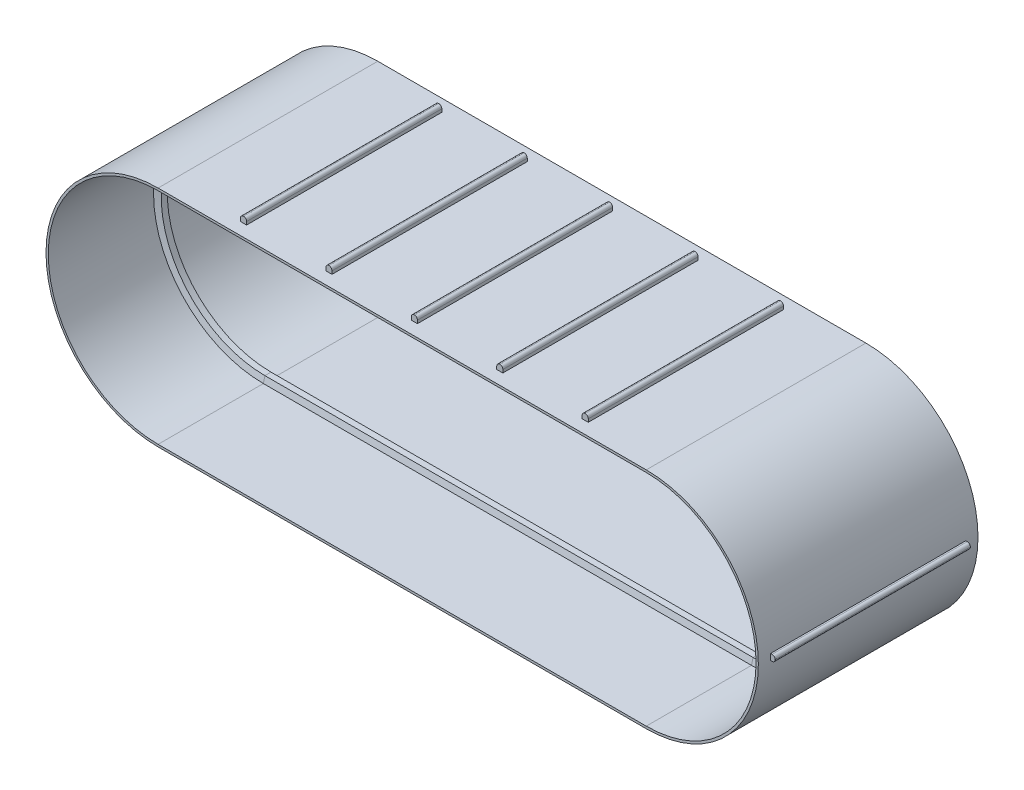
ISO-10303-21;
HEADER;
FILE_DESCRIPTION(('STEP AP214'),'2;1');
FILE_NAME('part.step','',(''),(''),'','','');
FILE_SCHEMA(('AUTOMOTIVE_DESIGN { 1 0 10303 214 1 1 1 1 }'));
ENDSEC;
DATA;
#1=APPLICATION_CONTEXT('core data for automotive mechanical design processes');
#2=APPLICATION_PROTOCOL_DEFINITION('international standard','automotive_design',2000,#1);
#3=PRODUCT_CONTEXT('',#1,'mechanical');
#4=PRODUCT('Part','Part','',(#3));
#5=PRODUCT_RELATED_PRODUCT_CATEGORY('part','',(#4));
#6=PRODUCT_DEFINITION_FORMATION('','',#4);
#7=PRODUCT_DEFINITION_CONTEXT('part definition',#1,'design');
#8=PRODUCT_DEFINITION('design','',#6,#7);
#9=PRODUCT_DEFINITION_SHAPE('','',#8);
#10=(LENGTH_UNIT() NAMED_UNIT(*) SI_UNIT(.MILLI.,.METRE.));
#11=(NAMED_UNIT(*) PLANE_ANGLE_UNIT() SI_UNIT($,.RADIAN.));
#12=(NAMED_UNIT(*) SI_UNIT($,.STERADIAN.) SOLID_ANGLE_UNIT());
#13=UNCERTAINTY_MEASURE_WITH_UNIT(LENGTH_MEASURE(1.E-05),#10,'distance_accuracy_value','');
#14=(GEOMETRIC_REPRESENTATION_CONTEXT(3) GLOBAL_UNCERTAINTY_ASSIGNED_CONTEXT((#13)) GLOBAL_UNIT_ASSIGNED_CONTEXT((#10,
#11,#12)) REPRESENTATION_CONTEXT('',''));
#15=CARTESIAN_POINT('',(0.,0.,0.));
#16=DIRECTION('',(0.,0.,1.));
#17=DIRECTION('',(1.,0.,0.));
#18=AXIS2_PLACEMENT_3D('',#15,#16,#17);
#19=CARTESIAN_POINT('',(750.9256,-6.34999999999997,-203.2));
#20=DIRECTION('',(0.,0.,1.));
#21=DIRECTION('',(1.,0.,0.));
#22=AXIS2_PLACEMENT_3D('',#19,#20,#21);
#23=PLANE('',#22);
#24=DIRECTION('',(-1.,0.,0.));
#25=VECTOR('',#24,1.);
#26=CARTESIAN_POINT('',(750.9256,6.35000000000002,-203.2));
#27=LINE('',#26,#25);
#28=CARTESIAN_POINT('',(744.5756,6.35000000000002,-203.2));
#29=VERTEX_POINT('',#28);
#30=CARTESIAN_POINT('',(741.3498,6.35000000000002,-203.2));
#31=VERTEX_POINT('',#30);
#32=EDGE_CURVE('E84',#29,#31,#27,.T.);
#33=ORIENTED_EDGE('',*,*,#32,.F.);
#34=CARTESIAN_POINT('',(744.5756,0.,-203.2));
#35=DIRECTION('',(0.,0.,1.));
#36=DIRECTION('',(1.,0.,0.));
#37=AXIS2_PLACEMENT_3D('',#34,#35,#36);
#38=CIRCLE('',#37,6.35);
#39=CARTESIAN_POINT('',(750.9256,0.,-203.2));
#40=VERTEX_POINT('',#39);
#41=EDGE_CURVE('E12',#29,#40,#38,.F.);
#42=ORIENTED_EDGE('',*,*,#41,.T.);
#43=CARTESIAN_POINT('',(744.5756,0.,-203.2));
#44=DIRECTION('',(0.,0.,1.));
#45=DIRECTION('',(1.,0.,0.));
#46=AXIS2_PLACEMENT_3D('',#43,#44,#45);
#47=CIRCLE('',#46,6.35);
#48=CARTESIAN_POINT('',(744.5756,-6.34999999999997,-203.2));
#49=VERTEX_POINT('',#48);
#50=EDGE_CURVE('E117',#40,#49,#47,.F.);
#51=ORIENTED_EDGE('',*,*,#50,.T.);
#52=DIRECTION('',(-1.,0.,0.));
#53=VECTOR('',#52,1.);
#54=CARTESIAN_POINT('',(750.9256,-6.34999999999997,-203.2));
#55=LINE('',#54,#53);
#56=CARTESIAN_POINT('',(741.3498,-6.34999999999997,-203.2));
#57=VERTEX_POINT('',#56);
#58=EDGE_CURVE('E104',#49,#57,#55,.T.);
#59=ORIENTED_EDGE('',*,*,#58,.T.);
#60=DIRECTION('',(0.,1.,0.));
#61=VECTOR('',#60,1.);
#62=CARTESIAN_POINT('',(741.3498,-6.34999999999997,-203.2));
#63=LINE('',#62,#61);
#64=EDGE_CURVE('E99',#57,#31,#63,.T.);
#65=ORIENTED_EDGE('',*,*,#64,.T.);
#66=EDGE_LOOP('',(#33,#42,#51,#59,#65));
#67=FACE_BOUND('',#66,.T.);
#68=ADVANCED_FACE('F42',(#67),#23,.F.);
#69=CARTESIAN_POINT('',(750.9256,6.35000000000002,-203.2));
#70=DIRECTION('',(0.,-1.,0.));
#71=DIRECTION('',(0.,0.,-1.));
#72=AXIS2_PLACEMENT_3D('',#69,#70,#71);
#73=PLANE('',#72);
#74=DIRECTION('',(-1.,0.,0.));
#75=VECTOR('',#74,1.);
#76=CARTESIAN_POINT('',(750.9256,6.34999999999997,203.2));
#77=LINE('',#76,#75);
#78=CARTESIAN_POINT('',(744.5756,6.34999999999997,203.2));
#79=VERTEX_POINT('',#78);
#80=CARTESIAN_POINT('',(741.3498,6.34999999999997,203.2));
#81=VERTEX_POINT('',#80);
#82=EDGE_CURVE('E93',#79,#81,#77,.T.);
#83=ORIENTED_EDGE('',*,*,#82,.F.);
#84=DIRECTION('',(0.,0.,1.));
#85=VECTOR('',#84,1.);
#86=CARTESIAN_POINT('',(744.5756,6.35000000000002,-203.2));
#87=LINE('',#86,#85);
#88=EDGE_CURVE('E49',#79,#29,#87,.F.);
#89=ORIENTED_EDGE('',*,*,#88,.T.);
#90=ORIENTED_EDGE('',*,*,#32,.T.);
#91=DIRECTION('',(0.,0.,1.));
#92=VECTOR('',#91,1.);
#93=CARTESIAN_POINT('',(741.3498,6.35000000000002,-203.2));
#94=LINE('',#93,#92);
#95=EDGE_CURVE('E87',#31,#81,#94,.T.);
#96=ORIENTED_EDGE('',*,*,#95,.T.);
#97=EDGE_LOOP('',(#83,#89,#90,#96));
#98=FACE_BOUND('',#97,.T.);
#99=ADVANCED_FACE('F86',(#98),#73,.F.);
#100=CARTESIAN_POINT('',(750.9256,-6.35000000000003,203.2));
#101=DIRECTION('',(0.,0.,-1.));
#102=DIRECTION('',(-1.,0.,0.));
#103=AXIS2_PLACEMENT_3D('',#100,#101,#102);
#104=PLANE('',#103);
#105=CARTESIAN_POINT('',(744.5756,0.,203.2));
#106=DIRECTION('',(0.,0.,-1.));
#107=DIRECTION('',(-1.,0.,0.));
#108=AXIS2_PLACEMENT_3D('',#105,#106,#107);
#109=CIRCLE('',#108,6.35);
#110=CARTESIAN_POINT('',(744.5756,-6.35000000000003,203.2));
#111=VERTEX_POINT('',#110);
#112=CARTESIAN_POINT('',(750.9256,0.,203.2));
#113=VERTEX_POINT('',#112);
#114=EDGE_CURVE('E121',#111,#113,#109,.F.);
#115=ORIENTED_EDGE('',*,*,#114,.T.);
#116=CARTESIAN_POINT('',(744.5756,0.,203.2));
#117=DIRECTION('',(0.,0.,-1.));
#118=DIRECTION('',(-1.,0.,0.));
#119=AXIS2_PLACEMENT_3D('',#116,#117,#118);
#120=CIRCLE('',#119,6.35);
#121=EDGE_CURVE('E63',#113,#79,#120,.F.);
#122=ORIENTED_EDGE('',*,*,#121,.T.);
#123=ORIENTED_EDGE('',*,*,#82,.T.);
#124=DIRECTION('',(0.,-1.,0.));
#125=VECTOR('',#124,1.);
#126=CARTESIAN_POINT('',(741.3498,-6.35000000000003,203.2));
#127=LINE('',#126,#125);
#128=CARTESIAN_POINT('',(741.3498,-6.35000000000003,203.2));
#129=VERTEX_POINT('',#128);
#130=EDGE_CURVE('E101',#81,#129,#127,.T.);
#131=ORIENTED_EDGE('',*,*,#130,.T.);
#132=DIRECTION('',(-1.,0.,0.));
#133=VECTOR('',#132,1.);
#134=CARTESIAN_POINT('',(750.9256,-6.35000000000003,203.2));
#135=LINE('',#134,#133);
#136=EDGE_CURVE('E112',#111,#129,#135,.T.);
#137=ORIENTED_EDGE('',*,*,#136,.F.);
#138=EDGE_LOOP('',(#115,#122,#123,#131,#137));
#139=FACE_BOUND('',#138,.T.);
#140=ADVANCED_FACE('F126',(#139),#104,.F.);
#141=CARTESIAN_POINT('',(750.9256,-6.34999999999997,-203.2));
#142=DIRECTION('',(0.,1.,0.));
#143=DIRECTION('',(0.,0.,1.));
#144=AXIS2_PLACEMENT_3D('',#141,#142,#143);
#145=PLANE('',#144);
#146=ORIENTED_EDGE('',*,*,#58,.F.);
#147=DIRECTION('',(0.,0.,-1.));
#148=VECTOR('',#147,1.);
#149=CARTESIAN_POINT('',(744.5756,-6.35000000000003,203.2));
#150=LINE('',#149,#148);
#151=EDGE_CURVE('E119',#49,#111,#150,.F.);
#152=ORIENTED_EDGE('',*,*,#151,.T.);
#153=ORIENTED_EDGE('',*,*,#136,.T.);
#154=DIRECTION('',(0.,0.,-1.));
#155=VECTOR('',#154,1.);
#156=CARTESIAN_POINT('',(741.3498,-6.34999999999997,-203.2));
#157=LINE('',#156,#155);
#158=EDGE_CURVE('E109',#129,#57,#157,.T.);
#159=ORIENTED_EDGE('',*,*,#158,.T.);
#160=EDGE_LOOP('',(#146,#152,#153,#159));
#161=FACE_BOUND('',#160,.T.);
#162=ADVANCED_FACE('F134',(#161),#145,.F.);
#163=CARTESIAN_POINT('',(741.3498,6.35000000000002,-203.2));
#164=DIRECTION('',(1.,0.,0.));
#165=DIRECTION('',(0.,0.,-1.));
#166=AXIS2_PLACEMENT_3D('',#163,#164,#165);
#167=PLANE('',#166);
#168=ORIENTED_EDGE('',*,*,#64,.F.);
#169=ORIENTED_EDGE('',*,*,#158,.F.);
#170=ORIENTED_EDGE('',*,*,#130,.F.);
#171=ORIENTED_EDGE('',*,*,#95,.F.);
#172=EDGE_LOOP('',(#168,#169,#170,#171));
#173=FACE_BOUND('',#172,.T.);
#174=ADVANCED_FACE('F97',(#173),#167,.F.);
#175=CARTESIAN_POINT('',(744.5756,0.,-203.2));
#176=DIRECTION('',(0.,0.,1.));
#177=DIRECTION('',(0.,-1.,0.));
#178=AXIS2_PLACEMENT_3D('',#175,#176,#177);
#179=CYLINDRICAL_SURFACE('',#178,6.35);
#180=ORIENTED_EDGE('',*,*,#114,.F.);
#181=ORIENTED_EDGE('',*,*,#151,.F.);
#182=ORIENTED_EDGE('',*,*,#50,.F.);
#183=DIRECTION('',(0.,0.,-1.));
#184=VECTOR('',#183,1.);
#185=CARTESIAN_POINT('',(750.9256,0.,-203.2));
#186=LINE('',#185,#184);
#187=EDGE_CURVE('E92',#113,#40,#186,.T.);
#188=ORIENTED_EDGE('',*,*,#187,.F.);
#189=EDGE_LOOP('',(#180,#181,#182,#188));
#190=FACE_BOUND('',#189,.T.);
#191=ADVANCED_FACE('F130',(#190),#179,.T.);
#192=CARTESIAN_POINT('',(744.5756,0.,-203.2));
#193=DIRECTION('',(0.,0.,-1.));
#194=DIRECTION('',(0.,1.,0.));
#195=AXIS2_PLACEMENT_3D('',#192,#193,#194);
#196=CYLINDRICAL_SURFACE('',#195,6.35);
#197=ORIENTED_EDGE('',*,*,#41,.F.);
#198=ORIENTED_EDGE('',*,*,#88,.F.);
#199=ORIENTED_EDGE('',*,*,#121,.F.);
#200=ORIENTED_EDGE('',*,*,#187,.T.);
#201=EDGE_LOOP('',(#197,#198,#199,#200));
#202=FACE_BOUND('',#201,.T.);
#203=ADVANCED_FACE('F132',(#202),#196,.T.);
#204=CLOSED_SHELL('',(#68,#99,#140,#162,#174,#191,#203));
#205=MANIFOLD_SOLID_BREP('B2',#204);
#206=CARTESIAN_POINT('',(-508.,233.3498,228.6));
#207=DIRECTION('',(0.,-1.,0.));
#208=DIRECTION('',(0.,0.,-1.));
#209=AXIS2_PLACEMENT_3D('',#206,#207,#208);
#210=PLANE('',#209);
#211=DIRECTION('',(0.,0.,-1.));
#212=VECTOR('',#211,1.);
#213=CARTESIAN_POINT('',(-349.249999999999,233.3498,203.2));
#214=LINE('',#213,#212);
#215=CARTESIAN_POINT('',(-349.249999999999,233.3498,203.2));
#216=VERTEX_POINT('',#215);
#217=CARTESIAN_POINT('',(-349.249999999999,233.3498,-203.2));
#218=VERTEX_POINT('',#217);
#219=EDGE_CURVE('E996',#216,#218,#214,.T.);
#220=ORIENTED_EDGE('',*,*,#219,.F.);
#221=DIRECTION('',(1.,0.,0.));
#222=VECTOR('',#221,1.);
#223=CARTESIAN_POINT('',(-349.249999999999,233.3498,203.2));
#224=LINE('',#223,#222);
#225=CARTESIAN_POINT('',(-361.949999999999,233.3498,203.2));
#226=VERTEX_POINT('',#225);
#227=EDGE_CURVE('E998',#226,#216,#224,.T.);
#228=ORIENTED_EDGE('',*,*,#227,.F.);
#229=DIRECTION('',(0.,0.,1.));
#230=VECTOR('',#229,1.);
#231=CARTESIAN_POINT('',(-361.949999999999,233.3498,203.2));
#232=LINE('',#231,#230);
#233=CARTESIAN_POINT('',(-361.949999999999,233.3498,-203.2));
#234=VERTEX_POINT('',#233);
#235=EDGE_CURVE('E1001',#234,#226,#232,.T.);
#236=ORIENTED_EDGE('',*,*,#235,.F.);
#237=DIRECTION('',(-1.,0.,0.));
#238=VECTOR('',#237,1.);
#239=CARTESIAN_POINT('',(-349.249999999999,233.3498,-203.2));
#240=LINE('',#239,#238);
#241=EDGE_CURVE('E1004',#218,#234,#240,.T.);
#242=ORIENTED_EDGE('',*,*,#241,.F.);
#243=EDGE_LOOP('',(#220,#228,#236,#242));
#244=FACE_BOUND('',#243,.T.);
#245=DIRECTION('',(0.,0.,-1.));
#246=VECTOR('',#245,1.);
#247=CARTESIAN_POINT('',(-171.45,233.3498,203.2));
#248=LINE('',#247,#246);
#249=CARTESIAN_POINT('',(-171.45,233.3498,203.2));
#250=VERTEX_POINT('',#249);
#251=CARTESIAN_POINT('',(-171.45,233.3498,-203.2));
#252=VERTEX_POINT('',#251);
#253=EDGE_CURVE('E803',#250,#252,#248,.T.);
#254=ORIENTED_EDGE('',*,*,#253,.F.);
#255=DIRECTION('',(1.,0.,0.));
#256=VECTOR('',#255,1.);
#257=CARTESIAN_POINT('',(-171.45,233.3498,203.2));
#258=LINE('',#257,#256);
#259=CARTESIAN_POINT('',(-184.15,233.3498,203.2));
#260=VERTEX_POINT('',#259);
#261=EDGE_CURVE('E762',#260,#250,#258,.T.);
#262=ORIENTED_EDGE('',*,*,#261,.F.);
#263=DIRECTION('',(0.,0.,1.));
#264=VECTOR('',#263,1.);
#265=CARTESIAN_POINT('',(-184.15,233.3498,203.2));
#266=LINE('',#265,#264);
#267=CARTESIAN_POINT('',(-184.15,233.3498,-203.2));
#268=VERTEX_POINT('',#267);
#269=EDGE_CURVE('E794',#268,#260,#266,.T.);
#270=ORIENTED_EDGE('',*,*,#269,.F.);
#271=DIRECTION('',(-1.,0.,0.));
#272=VECTOR('',#271,1.);
#273=CARTESIAN_POINT('',(-171.45,233.3498,-203.2));
#274=LINE('',#273,#272);
#275=EDGE_CURVE('E800',#252,#268,#274,.T.);
#276=ORIENTED_EDGE('',*,*,#275,.F.);
#277=EDGE_LOOP('',(#254,#262,#270,#276));
#278=FACE_BOUND('',#277,.T.);
#279=DIRECTION('',(-1.,0.,0.));
#280=VECTOR('',#279,1.);
#281=CARTESIAN_POINT('',(-508.,233.3498,-228.6));
#282=LINE('',#281,#280);
#283=CARTESIAN_POINT('',(508.,233.3498,-228.6));
#284=VERTEX_POINT('',#283);
#285=CARTESIAN_POINT('',(-508.,233.3498,-228.6));
#286=VERTEX_POINT('',#285);
#287=EDGE_CURVE('E957',#284,#286,#282,.T.);
#288=ORIENTED_EDGE('',*,*,#287,.T.);
#289=DIRECTION('',(0.,0.,-1.));
#290=VECTOR('',#289,1.);
#291=CARTESIAN_POINT('',(-508.,233.3498,228.6));
#292=LINE('',#291,#290);
#293=CARTESIAN_POINT('',(-508.,233.3498,228.6));
#294=VERTEX_POINT('',#293);
#295=EDGE_CURVE('E968',#294,#286,#292,.T.);
#296=ORIENTED_EDGE('',*,*,#295,.F.);
#297=DIRECTION('',(-1.,0.,0.));
#298=VECTOR('',#297,1.);
#299=CARTESIAN_POINT('',(-508.,233.3498,228.6));
#300=LINE('',#299,#298);
#301=CARTESIAN_POINT('',(508.,233.3498,228.6));
#302=VERTEX_POINT('',#301);
#303=EDGE_CURVE('E966',#302,#294,#300,.T.);
#304=ORIENTED_EDGE('',*,*,#303,.F.);
#305=DIRECTION('',(0.,0.,-1.));
#306=VECTOR('',#305,1.);
#307=CARTESIAN_POINT('',(508.,233.3498,228.6));
#308=LINE('',#307,#306);
#309=EDGE_CURVE('E971',#302,#284,#308,.T.);
#310=ORIENTED_EDGE('',*,*,#309,.T.);
#311=EDGE_LOOP('',(#288,#296,#304,#310));
#312=FACE_BOUND('',#311,.T.);
#313=DIRECTION('',(0.,0.,-1.));
#314=VECTOR('',#313,1.);
#315=CARTESIAN_POINT('',(6.35000000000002,233.3498,203.2));
#316=LINE('',#315,#314);
#317=CARTESIAN_POINT('',(6.35000000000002,233.3498,203.2));
#318=VERTEX_POINT('',#317);
#319=CARTESIAN_POINT('',(6.34999999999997,233.3498,-203.2));
#320=VERTEX_POINT('',#319);
#321=EDGE_CURVE('E806',#318,#320,#316,.T.);
#322=ORIENTED_EDGE('',*,*,#321,.F.);
#323=DIRECTION('',(1.,0.,0.));
#324=VECTOR('',#323,1.);
#325=CARTESIAN_POINT('',(6.35000000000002,233.3498,203.2));
#326=LINE('',#325,#324);
#327=CARTESIAN_POINT('',(-6.34999999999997,233.3498,203.2));
#328=VERTEX_POINT('',#327);
#329=EDGE_CURVE('E815',#328,#318,#326,.T.);
#330=ORIENTED_EDGE('',*,*,#329,.F.);
#331=DIRECTION('',(0.,0.,1.));
#332=VECTOR('',#331,1.);
#333=CARTESIAN_POINT('',(-6.34999999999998,233.3498,203.2));
#334=LINE('',#333,#332);
#335=CARTESIAN_POINT('',(-6.35000000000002,233.3498,-203.2));
#336=VERTEX_POINT('',#335);
#337=EDGE_CURVE('E812',#336,#328,#334,.T.);
#338=ORIENTED_EDGE('',*,*,#337,.F.);
#339=DIRECTION('',(-1.,0.,0.));
#340=VECTOR('',#339,1.);
#341=CARTESIAN_POINT('',(6.34999999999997,233.3498,-203.2));
#342=LINE('',#341,#340);
#343=EDGE_CURVE('E809',#320,#336,#342,.T.);
#344=ORIENTED_EDGE('',*,*,#343,.F.);
#345=EDGE_LOOP('',(#322,#330,#338,#344));
#346=FACE_BOUND('',#345,.T.);
#347=DIRECTION('',(0.,0.,-1.));
#348=VECTOR('',#347,1.);
#349=CARTESIAN_POINT('',(184.15,233.3498,203.2));
#350=LINE('',#349,#348);
#351=CARTESIAN_POINT('',(184.15,233.3498,203.2));
#352=VERTEX_POINT('',#351);
#353=CARTESIAN_POINT('',(184.15,233.3498,-203.2));
#354=VERTEX_POINT('',#353);
#355=EDGE_CURVE('E759',#352,#354,#350,.T.);
#356=ORIENTED_EDGE('',*,*,#355,.F.);
#357=DIRECTION('',(1.,0.,0.));
#358=VECTOR('',#357,1.);
#359=CARTESIAN_POINT('',(184.15,233.3498,203.2));
#360=LINE('',#359,#358);
#361=CARTESIAN_POINT('',(171.45,233.3498,203.2));
#362=VERTEX_POINT('',#361);
#363=EDGE_CURVE('E718',#362,#352,#360,.T.);
#364=ORIENTED_EDGE('',*,*,#363,.F.);
#365=DIRECTION('',(0.,0.,1.));
#366=VECTOR('',#365,1.);
#367=CARTESIAN_POINT('',(171.45,233.3498,203.2));
#368=LINE('',#367,#366);
#369=CARTESIAN_POINT('',(171.45,233.3498,-203.2));
#370=VERTEX_POINT('',#369);
#371=EDGE_CURVE('E750',#370,#362,#368,.T.);
#372=ORIENTED_EDGE('',*,*,#371,.F.);
#373=DIRECTION('',(-1.,0.,0.));
#374=VECTOR('',#373,1.);
#375=CARTESIAN_POINT('',(184.15,233.3498,-203.2));
#376=LINE('',#375,#374);
#377=EDGE_CURVE('E756',#354,#370,#376,.T.);
#378=ORIENTED_EDGE('',*,*,#377,.F.);
#379=EDGE_LOOP('',(#356,#364,#372,#378));
#380=FACE_BOUND('',#379,.T.);
#381=DIRECTION('',(0.,0.,-1.));
#382=VECTOR('',#381,1.);
#383=CARTESIAN_POINT('',(361.949999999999,233.3498,203.2));
#384=LINE('',#383,#382);
#385=CARTESIAN_POINT('',(361.949999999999,233.3498,203.2));
#386=VERTEX_POINT('',#385);
#387=CARTESIAN_POINT('',(361.949999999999,233.3498,-203.2));
#388=VERTEX_POINT('',#387);
#389=EDGE_CURVE('E1037',#386,#388,#384,.T.);
#390=ORIENTED_EDGE('',*,*,#389,.F.);
#391=DIRECTION('',(1.,0.,0.));
#392=VECTOR('',#391,1.);
#393=CARTESIAN_POINT('',(361.949999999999,233.3498,203.2));
#394=LINE('',#393,#392);
#395=CARTESIAN_POINT('',(349.249999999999,233.3498,203.2));
#396=VERTEX_POINT('',#395);
#397=EDGE_CURVE('E1039',#396,#386,#394,.T.);
#398=ORIENTED_EDGE('',*,*,#397,.F.);
#399=DIRECTION('',(0.,0.,1.));
#400=VECTOR('',#399,1.);
#401=CARTESIAN_POINT('',(349.249999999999,233.3498,203.2));
#402=LINE('',#401,#400);
#403=CARTESIAN_POINT('',(349.249999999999,233.3498,-203.2));
#404=VERTEX_POINT('',#403);
#405=EDGE_CURVE('E1042',#404,#396,#402,.T.);
#406=ORIENTED_EDGE('',*,*,#405,.F.);
#407=DIRECTION('',(-1.,0.,0.));
#408=VECTOR('',#407,1.);
#409=CARTESIAN_POINT('',(361.949999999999,233.3498,-203.2));
#410=LINE('',#409,#408);
#411=EDGE_CURVE('E1045',#388,#404,#410,.T.);
#412=ORIENTED_EDGE('',*,*,#411,.F.);
#413=EDGE_LOOP('',(#390,#398,#406,#412));
#414=FACE_BOUND('',#413,.T.);
#415=ADVANCED_FACE('F191',(#244,#278,#312,#346,#380,#414),#210,.F.);
#416=CARTESIAN_POINT('',(-508.,0.,228.6));
#417=DIRECTION('',(0.,0.,-1.));
#418=DIRECTION('',(-1.,0.,0.));
#419=AXIS2_PLACEMENT_3D('',#416,#417,#418);
#420=CYLINDRICAL_SURFACE('',#419,228.6);
#421=DIRECTION('',(0.,0.,-1.));
#422=VECTOR('',#421,1.);
#423=CARTESIAN_POINT('',(-508.,-228.6,228.6));
#424=LINE('',#423,#422);
#425=CARTESIAN_POINT('',(-508.,-228.6,228.6));
#426=VERTEX_POINT('',#425);
#427=CARTESIAN_POINT('',(-508.,-228.6,9.52499999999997));
#428=VERTEX_POINT('',#427);
#429=EDGE_CURVE('E947',#426,#428,#424,.T.);
#430=ORIENTED_EDGE('',*,*,#429,.T.);
#431=CARTESIAN_POINT('',(-508.,0.,9.52499999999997));
#432=DIRECTION('',(0.,0.,-1.));
#433=DIRECTION('',(-1.,0.,0.));
#434=AXIS2_PLACEMENT_3D('',#431,#432,#433);
#435=CIRCLE('',#434,228.6);
#436=CARTESIAN_POINT('',(-508.,228.6,9.52499999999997));
#437=VERTEX_POINT('',#436);
#438=EDGE_CURVE('E854',#428,#437,#435,.T.);
#439=ORIENTED_EDGE('',*,*,#438,.T.);
#440=DIRECTION('',(0.,0.,-1.));
#441=VECTOR('',#440,1.);
#442=CARTESIAN_POINT('',(-508.,228.6,228.6));
#443=LINE('',#442,#441);
#444=CARTESIAN_POINT('',(-508.,228.6,228.6));
#445=VERTEX_POINT('',#444);
#446=EDGE_CURVE('E935',#445,#437,#443,.T.);
#447=ORIENTED_EDGE('',*,*,#446,.F.);
#448=CARTESIAN_POINT('',(-508.,0.,228.6));
#449=DIRECTION('',(0.,0.,1.));
#450=DIRECTION('',(1.,0.,0.));
#451=AXIS2_PLACEMENT_3D('',#448,#449,#450);
#452=CIRCLE('',#451,228.6);
#453=EDGE_CURVE('E925',#445,#426,#452,.T.);
#454=ORIENTED_EDGE('',*,*,#453,.T.);
#455=EDGE_LOOP('',(#430,#439,#447,#454));
#456=FACE_BOUND('',#455,.T.);
#457=ADVANCED_FACE('F1172',(#456),#420,.F.);
#458=CARTESIAN_POINT('',(-508.,228.6,-9.52500000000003));
#459=VERTEX_POINT('',#458);
#460=CARTESIAN_POINT('',(-508.,228.6,-228.6));
#461=VERTEX_POINT('',#460);
#462=EDGE_CURVE('E934',#459,#461,#443,.T.);
#463=ORIENTED_EDGE('',*,*,#462,.F.);
#464=CARTESIAN_POINT('',(-508.,0.,-9.52500000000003));
#465=DIRECTION('',(0.,0.,-1.));
#466=DIRECTION('',(-1.,0.,0.));
#467=AXIS2_PLACEMENT_3D('',#464,#465,#466);
#468=CIRCLE('',#467,228.6);
#469=CARTESIAN_POINT('',(-508.,-228.6,-9.52500000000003));
#470=VERTEX_POINT('',#469);
#471=EDGE_CURVE('E846',#470,#459,#468,.T.);
#472=ORIENTED_EDGE('',*,*,#471,.F.);
#473=CARTESIAN_POINT('',(-508.,-228.6,-228.6));
#474=VERTEX_POINT('',#473);
#475=EDGE_CURVE('E946',#470,#474,#424,.T.);
#476=ORIENTED_EDGE('',*,*,#475,.T.);
#477=CARTESIAN_POINT('',(-508.,0.,-228.6));
#478=DIRECTION('',(0.,0.,1.));
#479=DIRECTION('',(1.,0.,0.));
#480=AXIS2_PLACEMENT_3D('',#477,#478,#479);
#481=CIRCLE('',#480,228.6);
#482=EDGE_CURVE('E898',#461,#474,#481,.T.);
#483=ORIENTED_EDGE('',*,*,#482,.F.);
#484=EDGE_LOOP('',(#463,#472,#476,#483));
#485=FACE_BOUND('',#484,.T.);
#486=ADVANCED_FACE('F1178',(#485),#420,.F.);
#487=CARTESIAN_POINT('',(-508.,-228.6,228.6));
#488=DIRECTION('',(0.,1.,0.));
#489=DIRECTION('',(0.,0.,1.));
#490=AXIS2_PLACEMENT_3D('',#487,#488,#489);
#491=PLANE('',#490);
#492=DIRECTION('',(1.,0.,0.));
#493=VECTOR('',#492,1.);
#494=CARTESIAN_POINT('',(-508.,-228.6,9.52499999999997));
#495=LINE('',#494,#493);
#496=CARTESIAN_POINT('',(508.,-228.6,9.52499999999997));
#497=VERTEX_POINT('',#496);
#498=EDGE_CURVE('E840',#428,#497,#495,.T.);
#499=ORIENTED_EDGE('',*,*,#498,.F.);
#500=ORIENTED_EDGE('',*,*,#429,.F.);
#501=DIRECTION('',(1.,0.,0.));
#502=VECTOR('',#501,1.);
#503=CARTESIAN_POINT('',(-508.,-228.6,228.6));
#504=LINE('',#503,#502);
#505=CARTESIAN_POINT('',(508.,-228.6,228.6));
#506=VERTEX_POINT('',#505);
#507=EDGE_CURVE('E927',#426,#506,#504,.T.);
#508=ORIENTED_EDGE('',*,*,#507,.T.);
#509=DIRECTION('',(0.,0.,-1.));
#510=VECTOR('',#509,1.);
#511=CARTESIAN_POINT('',(508.,-228.6,228.6));
#512=LINE('',#511,#510);
#513=EDGE_CURVE('E943',#506,#497,#512,.T.);
#514=ORIENTED_EDGE('',*,*,#513,.T.);
#515=EDGE_LOOP('',(#499,#500,#508,#514));
#516=FACE_BOUND('',#515,.T.);
#517=ADVANCED_FACE('F1381',(#516),#491,.T.);
#518=CARTESIAN_POINT('',(508.,0.,228.6));
#519=DIRECTION('',(0.,0.,-1.));
#520=DIRECTION('',(-1.,0.,0.));
#521=AXIS2_PLACEMENT_3D('',#518,#519,#520);
#522=CYLINDRICAL_SURFACE('',#521,228.6);
#523=DIRECTION('',(0.,0.,-1.));
#524=VECTOR('',#523,1.);
#525=CARTESIAN_POINT('',(508.,228.6,228.6));
#526=LINE('',#525,#524);
#527=CARTESIAN_POINT('',(508.,228.6,228.6));
#528=VERTEX_POINT('',#527);
#529=CARTESIAN_POINT('',(508.,228.6,9.52499999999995));
#530=VERTEX_POINT('',#529);
#531=EDGE_CURVE('E939',#528,#530,#526,.T.);
#532=ORIENTED_EDGE('',*,*,#531,.T.);
#533=CARTESIAN_POINT('',(508.,0.,9.52499999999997));
#534=DIRECTION('',(0.,0.,-1.));
#535=DIRECTION('',(-1.,0.,0.));
#536=AXIS2_PLACEMENT_3D('',#533,#534,#535);
#537=CIRCLE('',#536,228.6);
#538=EDGE_CURVE('E895',#530,#497,#537,.T.);
#539=ORIENTED_EDGE('',*,*,#538,.T.);
#540=ORIENTED_EDGE('',*,*,#513,.F.);
#541=CARTESIAN_POINT('',(508.,0.,228.6));
#542=DIRECTION('',(0.,0.,1.));
#543=DIRECTION('',(1.,0.,0.));
#544=AXIS2_PLACEMENT_3D('',#541,#542,#543);
#545=CIRCLE('',#544,228.6);
#546=EDGE_CURVE('E929',#506,#528,#545,.T.);
#547=ORIENTED_EDGE('',*,*,#546,.T.);
#548=EDGE_LOOP('',(#532,#539,#540,#547));
#549=FACE_BOUND('',#548,.T.);
#550=ADVANCED_FACE('F1378',(#549),#522,.F.);
#551=CARTESIAN_POINT('',(508.,-228.6,-9.52500000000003));
#552=VERTEX_POINT('',#551);
#553=CARTESIAN_POINT('',(508.,-228.6,-228.6));
#554=VERTEX_POINT('',#553);
#555=EDGE_CURVE('E942',#552,#554,#512,.T.);
#556=ORIENTED_EDGE('',*,*,#555,.F.);
#557=CARTESIAN_POINT('',(508.,0.,-9.52500000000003));
#558=DIRECTION('',(0.,0.,-1.));
#559=DIRECTION('',(-1.,0.,0.));
#560=AXIS2_PLACEMENT_3D('',#557,#558,#559);
#561=CIRCLE('',#560,228.6);
#562=CARTESIAN_POINT('',(508.,228.6,-9.52500000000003));
#563=VERTEX_POINT('',#562);
#564=EDGE_CURVE('E886',#563,#552,#561,.T.);
#565=ORIENTED_EDGE('',*,*,#564,.F.);
#566=CARTESIAN_POINT('',(508.,228.6,-228.6));
#567=VERTEX_POINT('',#566);
#568=EDGE_CURVE('E938',#563,#567,#526,.T.);
#569=ORIENTED_EDGE('',*,*,#568,.T.);
#570=CARTESIAN_POINT('',(508.,0.,-228.6));
#571=DIRECTION('',(0.,0.,1.));
#572=DIRECTION('',(1.,0.,0.));
#573=AXIS2_PLACEMENT_3D('',#570,#571,#572);
#574=CIRCLE('',#573,228.6);
#575=EDGE_CURVE('E919',#554,#567,#574,.T.);
#576=ORIENTED_EDGE('',*,*,#575,.F.);
#577=EDGE_LOOP('',(#556,#565,#569,#576));
#578=FACE_BOUND('',#577,.T.);
#579=ADVANCED_FACE('F1376',(#578),#522,.F.);
#580=CARTESIAN_POINT('',(-508.,228.6,228.6));
#581=DIRECTION('',(0.,-1.,0.));
#582=DIRECTION('',(0.,0.,-1.));
#583=AXIS2_PLACEMENT_3D('',#580,#581,#582);
#584=PLANE('',#583);
#585=ORIENTED_EDGE('',*,*,#446,.T.);
#586=DIRECTION('',(1.,0.,0.));
#587=VECTOR('',#586,1.);
#588=CARTESIAN_POINT('',(-508.,228.6,9.52499999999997));
#589=LINE('',#588,#587);
#590=EDGE_CURVE('E874',#437,#530,#589,.T.);
#591=ORIENTED_EDGE('',*,*,#590,.T.);
#592=ORIENTED_EDGE('',*,*,#531,.F.);
#593=DIRECTION('',(-1.,0.,0.));
#594=VECTOR('',#593,1.);
#595=CARTESIAN_POINT('',(-508.,228.6,228.6));
#596=LINE('',#595,#594);
#597=EDGE_CURVE('E932',#528,#445,#596,.T.);
#598=ORIENTED_EDGE('',*,*,#597,.T.);
#599=EDGE_LOOP('',(#585,#591,#592,#598));
#600=FACE_BOUND('',#599,.T.);
#601=ADVANCED_FACE('F1372',(#600),#584,.T.);
#602=ORIENTED_EDGE('',*,*,#568,.F.);
#603=DIRECTION('',(1.,0.,0.));
#604=VECTOR('',#603,1.);
#605=CARTESIAN_POINT('',(-508.,228.6,-9.52500000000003));
#606=LINE('',#605,#604);
#607=EDGE_CURVE('E865',#459,#563,#606,.T.);
#608=ORIENTED_EDGE('',*,*,#607,.F.);
#609=ORIENTED_EDGE('',*,*,#462,.T.);
#610=DIRECTION('',(-1.,0.,0.));
#611=VECTOR('',#610,1.);
#612=CARTESIAN_POINT('',(-508.,228.6,-228.6));
#613=LINE('',#612,#611);
#614=EDGE_CURVE('E922',#567,#461,#613,.T.);
#615=ORIENTED_EDGE('',*,*,#614,.F.);
#616=EDGE_LOOP('',(#602,#608,#609,#615));
#617=FACE_BOUND('',#616,.T.);
#618=ADVANCED_FACE('F1375',(#617),#584,.T.);
#619=CARTESIAN_POINT('',(-508.,0.,228.6));
#620=DIRECTION('',(0.,0.,1.));
#621=DIRECTION('',(1.,0.,0.));
#622=AXIS2_PLACEMENT_3D('',#619,#620,#621);
#623=PLANE('',#622);
#624=CARTESIAN_POINT('',(-508.,0.,228.6));
#625=DIRECTION('',(0.,0.,1.));
#626=DIRECTION('',(1.,0.,0.));
#627=AXIS2_PLACEMENT_3D('',#624,#625,#626);
#628=CIRCLE('',#627,233.3498);
#629=CARTESIAN_POINT('',(-508.,-233.3498,228.6));
#630=VERTEX_POINT('',#629);
#631=EDGE_CURVE('E959',#294,#630,#628,.T.);
#632=ORIENTED_EDGE('',*,*,#631,.T.);
#633=DIRECTION('',(1.,0.,0.));
#634=VECTOR('',#633,1.);
#635=CARTESIAN_POINT('',(-508.,-233.3498,228.6));
#636=LINE('',#635,#634);
#637=CARTESIAN_POINT('',(508.,-233.3498,228.6));
#638=VERTEX_POINT('',#637);
#639=EDGE_CURVE('E962',#630,#638,#636,.T.);
#640=ORIENTED_EDGE('',*,*,#639,.T.);
#641=CARTESIAN_POINT('',(508.,0.,228.6));
#642=DIRECTION('',(0.,0.,1.));
#643=DIRECTION('',(1.,0.,0.));
#644=AXIS2_PLACEMENT_3D('',#641,#642,#643);
#645=CIRCLE('',#644,233.3498);
#646=EDGE_CURVE('E964',#638,#302,#645,.T.);
#647=ORIENTED_EDGE('',*,*,#646,.T.);
#648=ORIENTED_EDGE('',*,*,#303,.T.);
#649=EDGE_LOOP('',(#632,#640,#647,#648));
#650=FACE_BOUND('',#649,.T.);
#651=ORIENTED_EDGE('',*,*,#507,.F.);
#652=ORIENTED_EDGE('',*,*,#453,.F.);
#653=ORIENTED_EDGE('',*,*,#597,.F.);
#654=ORIENTED_EDGE('',*,*,#546,.F.);
#655=EDGE_LOOP('',(#651,#652,#653,#654));
#656=FACE_BOUND('',#655,.T.);
#657=ADVANCED_FACE('F1184',(#650,#656),#623,.T.);
#658=CARTESIAN_POINT('',(-508.,0.,-228.6));
#659=DIRECTION('',(0.,0.,1.));
#660=DIRECTION('',(1.,0.,0.));
#661=AXIS2_PLACEMENT_3D('',#658,#659,#660);
#662=PLANE('',#661);
#663=CARTESIAN_POINT('',(-508.,0.,-228.6));
#664=DIRECTION('',(0.,0.,1.));
#665=DIRECTION('',(1.,0.,0.));
#666=AXIS2_PLACEMENT_3D('',#663,#664,#665);
#667=CIRCLE('',#666,233.3498);
#668=CARTESIAN_POINT('',(-508.,-233.3498,-228.6));
#669=VERTEX_POINT('',#668);
#670=EDGE_CURVE('E950',#286,#669,#667,.T.);
#671=ORIENTED_EDGE('',*,*,#670,.F.);
#672=ORIENTED_EDGE('',*,*,#287,.F.);
#673=CARTESIAN_POINT('',(508.,0.,-228.6));
#674=DIRECTION('',(0.,0.,1.));
#675=DIRECTION('',(1.,0.,0.));
#676=AXIS2_PLACEMENT_3D('',#673,#674,#675);
#677=CIRCLE('',#676,233.3498);
#678=CARTESIAN_POINT('',(508.,-233.3498,-228.6));
#679=VERTEX_POINT('',#678);
#680=EDGE_CURVE('E955',#679,#284,#677,.T.);
#681=ORIENTED_EDGE('',*,*,#680,.F.);
#682=DIRECTION('',(1.,0.,0.));
#683=VECTOR('',#682,1.);
#684=CARTESIAN_POINT('',(-508.,-233.3498,-228.6));
#685=LINE('',#684,#683);
#686=EDGE_CURVE('E953',#669,#679,#685,.T.);
#687=ORIENTED_EDGE('',*,*,#686,.F.);
#688=EDGE_LOOP('',(#671,#672,#681,#687));
#689=FACE_BOUND('',#688,.T.);
#690=ORIENTED_EDGE('',*,*,#482,.T.);
#691=DIRECTION('',(1.,0.,0.));
#692=VECTOR('',#691,1.);
#693=CARTESIAN_POINT('',(-508.,-228.6,-228.6));
#694=LINE('',#693,#692);
#695=EDGE_CURVE('E916',#474,#554,#694,.T.);
#696=ORIENTED_EDGE('',*,*,#695,.T.);
#697=ORIENTED_EDGE('',*,*,#575,.T.);
#698=ORIENTED_EDGE('',*,*,#614,.T.);
#699=EDGE_LOOP('',(#690,#696,#697,#698));
#700=FACE_BOUND('',#699,.T.);
#701=ADVANCED_FACE('F1196',(#689,#700),#662,.F.);
#702=CARTESIAN_POINT('',(-508.,0.,228.6));
#703=DIRECTION('',(0.,0.,-1.));
#704=DIRECTION('',(-1.,0.,0.));
#705=AXIS2_PLACEMENT_3D('',#702,#703,#704);
#706=CYLINDRICAL_SURFACE('',#705,233.3498);
#707=ORIENTED_EDGE('',*,*,#670,.T.);
#708=DIRECTION('',(0.,0.,-1.));
#709=VECTOR('',#708,1.);
#710=CARTESIAN_POINT('',(-508.,-233.3498,228.6));
#711=LINE('',#710,#709);
#712=EDGE_CURVE('E977',#630,#669,#711,.T.);
#713=ORIENTED_EDGE('',*,*,#712,.F.);
#714=ORIENTED_EDGE('',*,*,#631,.F.);
#715=ORIENTED_EDGE('',*,*,#295,.T.);
#716=EDGE_LOOP('',(#707,#713,#714,#715));
#717=FACE_BOUND('',#716,.T.);
#718=ADVANCED_FACE('F1193',(#717),#706,.T.);
#719=CARTESIAN_POINT('',(-508.,-233.3498,228.6));
#720=DIRECTION('',(0.,1.,0.));
#721=DIRECTION('',(0.,0.,1.));
#722=AXIS2_PLACEMENT_3D('',#719,#720,#721);
#723=PLANE('',#722);
#724=DIRECTION('',(1.,0.,0.));
#725=VECTOR('',#724,1.);
#726=CARTESIAN_POINT('',(361.949999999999,-233.3498,203.2));
#727=LINE('',#726,#725);
#728=CARTESIAN_POINT('',(349.249999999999,-233.3498,203.2));
#729=VERTEX_POINT('',#728);
#730=CARTESIAN_POINT('',(361.949999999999,-233.3498,203.2));
#731=VERTEX_POINT('',#730);
#732=EDGE_CURVE('E607',#729,#731,#727,.T.);
#733=ORIENTED_EDGE('',*,*,#732,.T.);
#734=DIRECTION('',(0.,0.,-1.));
#735=VECTOR('',#734,1.);
#736=CARTESIAN_POINT('',(361.949999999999,-233.3498,203.2));
#737=LINE('',#736,#735);
#738=CARTESIAN_POINT('',(361.949999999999,-233.3498,-203.2));
#739=VERTEX_POINT('',#738);
#740=EDGE_CURVE('E618',#731,#739,#737,.T.);
#741=ORIENTED_EDGE('',*,*,#740,.T.);
#742=DIRECTION('',(-1.,0.,0.));
#743=VECTOR('',#742,1.);
#744=CARTESIAN_POINT('',(361.949999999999,-233.3498,-203.2));
#745=LINE('',#744,#743);
#746=CARTESIAN_POINT('',(349.249999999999,-233.3498,-203.2));
#747=VERTEX_POINT('',#746);
#748=EDGE_CURVE('E631',#739,#747,#745,.T.);
#749=ORIENTED_EDGE('',*,*,#748,.T.);
#750=DIRECTION('',(0.,0.,1.));
#751=VECTOR('',#750,1.);
#752=CARTESIAN_POINT('',(349.249999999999,-233.3498,203.2));
#753=LINE('',#752,#751);
#754=EDGE_CURVE('E629',#747,#729,#753,.T.);
#755=ORIENTED_EDGE('',*,*,#754,.T.);
#756=EDGE_LOOP('',(#733,#741,#749,#755));
#757=FACE_BOUND('',#756,.T.);
#758=DIRECTION('',(1.,0.,0.));
#759=VECTOR('',#758,1.);
#760=CARTESIAN_POINT('',(184.15,-233.3498,203.2));
#761=LINE('',#760,#759);
#762=CARTESIAN_POINT('',(171.45,-233.3498,203.2));
#763=VERTEX_POINT('',#762);
#764=CARTESIAN_POINT('',(184.15,-233.3498,203.2));
#765=VERTEX_POINT('',#764);
#766=EDGE_CURVE('E641',#763,#765,#761,.T.);
#767=ORIENTED_EDGE('',*,*,#766,.T.);
#768=DIRECTION('',(0.,0.,-1.));
#769=VECTOR('',#768,1.);
#770=CARTESIAN_POINT('',(184.15,-233.3498,203.2));
#771=LINE('',#770,#769);
#772=CARTESIAN_POINT('',(184.15,-233.3498,-203.2));
#773=VERTEX_POINT('',#772);
#774=EDGE_CURVE('E614',#765,#773,#771,.T.);
#775=ORIENTED_EDGE('',*,*,#774,.T.);
#776=DIRECTION('',(-1.,0.,0.));
#777=VECTOR('',#776,1.);
#778=CARTESIAN_POINT('',(184.15,-233.3498,-203.2));
#779=LINE('',#778,#777);
#780=CARTESIAN_POINT('',(171.45,-233.3498,-203.2));
#781=VERTEX_POINT('',#780);
#782=EDGE_CURVE('E647',#773,#781,#779,.T.);
#783=ORIENTED_EDGE('',*,*,#782,.T.);
#784=DIRECTION('',(0.,0.,1.));
#785=VECTOR('',#784,1.);
#786=CARTESIAN_POINT('',(171.45,-233.3498,203.2));
#787=LINE('',#786,#785);
#788=EDGE_CURVE('E644',#781,#763,#787,.T.);
#789=ORIENTED_EDGE('',*,*,#788,.T.);
#790=EDGE_LOOP('',(#767,#775,#783,#789));
#791=FACE_BOUND('',#790,.T.);
#792=DIRECTION('',(1.,0.,0.));
#793=VECTOR('',#792,1.);
#794=CARTESIAN_POINT('',(-349.249999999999,-233.3498,203.2));
#795=LINE('',#794,#793);
#796=CARTESIAN_POINT('',(-361.949999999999,-233.3498,203.2));
#797=VERTEX_POINT('',#796);
#798=CARTESIAN_POINT('',(-349.249999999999,-233.3498,203.2));
#799=VERTEX_POINT('',#798);
#800=EDGE_CURVE('E661',#797,#799,#795,.T.);
#801=ORIENTED_EDGE('',*,*,#800,.T.);
#802=DIRECTION('',(0.,0.,-1.));
#803=VECTOR('',#802,1.);
#804=CARTESIAN_POINT('',(-349.249999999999,-233.3498,203.2));
#805=LINE('',#804,#803);
#806=CARTESIAN_POINT('',(-349.249999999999,-233.3498,-203.2));
#807=VERTEX_POINT('',#806);
#808=EDGE_CURVE('E658',#799,#807,#805,.T.);
#809=ORIENTED_EDGE('',*,*,#808,.T.);
#810=DIRECTION('',(-1.,0.,0.));
#811=VECTOR('',#810,1.);
#812=CARTESIAN_POINT('',(-349.249999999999,-233.3498,-203.2));
#813=LINE('',#812,#811);
#814=CARTESIAN_POINT('',(-361.95,-233.3498,-203.2));
#815=VERTEX_POINT('',#814);
#816=EDGE_CURVE('E667',#807,#815,#813,.T.);
#817=ORIENTED_EDGE('',*,*,#816,.T.);
#818=DIRECTION('',(0.,0.,1.));
#819=VECTOR('',#818,1.);
#820=CARTESIAN_POINT('',(-361.949999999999,-233.3498,203.2));
#821=LINE('',#820,#819);
#822=EDGE_CURVE('E664',#815,#797,#821,.T.);
#823=ORIENTED_EDGE('',*,*,#822,.T.);
#824=EDGE_LOOP('',(#801,#809,#817,#823));
#825=FACE_BOUND('',#824,.T.);
#826=DIRECTION('',(1.,0.,0.));
#827=VECTOR('',#826,1.);
#828=CARTESIAN_POINT('',(-171.45,-233.3498,203.2));
#829=LINE('',#828,#827);
#830=CARTESIAN_POINT('',(-184.15,-233.3498,203.2));
#831=VERTEX_POINT('',#830);
#832=CARTESIAN_POINT('',(-171.45,-233.3498,203.2));
#833=VERTEX_POINT('',#832);
#834=EDGE_CURVE('E681',#831,#833,#829,.T.);
#835=ORIENTED_EDGE('',*,*,#834,.T.);
#836=DIRECTION('',(0.,0.,-1.));
#837=VECTOR('',#836,1.);
#838=CARTESIAN_POINT('',(-171.45,-233.3498,203.2));
#839=LINE('',#838,#837);
#840=CARTESIAN_POINT('',(-171.45,-233.3498,-203.2));
#841=VERTEX_POINT('',#840);
#842=EDGE_CURVE('E678',#833,#841,#839,.T.);
#843=ORIENTED_EDGE('',*,*,#842,.T.);
#844=DIRECTION('',(-1.,0.,0.));
#845=VECTOR('',#844,1.);
#846=CARTESIAN_POINT('',(-171.45,-233.3498,-203.2));
#847=LINE('',#846,#845);
#848=CARTESIAN_POINT('',(-184.15,-233.3498,-203.2));
#849=VERTEX_POINT('',#848);
#850=EDGE_CURVE('E687',#841,#849,#847,.T.);
#851=ORIENTED_EDGE('',*,*,#850,.T.);
#852=DIRECTION('',(0.,0.,1.));
#853=VECTOR('',#852,1.);
#854=CARTESIAN_POINT('',(-184.15,-233.3498,203.2));
#855=LINE('',#854,#853);
#856=EDGE_CURVE('E684',#849,#831,#855,.T.);
#857=ORIENTED_EDGE('',*,*,#856,.T.);
#858=EDGE_LOOP('',(#835,#843,#851,#857));
#859=FACE_BOUND('',#858,.T.);
#860=DIRECTION('',(1.,0.,0.));
#861=VECTOR('',#860,1.);
#862=CARTESIAN_POINT('',(6.35000000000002,-233.3498,203.2));
#863=LINE('',#862,#861);
#864=CARTESIAN_POINT('',(-6.34999999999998,-233.3498,203.2));
#865=VERTEX_POINT('',#864);
#866=CARTESIAN_POINT('',(6.35000000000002,-233.3498,203.2));
#867=VERTEX_POINT('',#866);
#868=EDGE_CURVE('E701',#865,#867,#863,.T.);
#869=ORIENTED_EDGE('',*,*,#868,.T.);
#870=DIRECTION('',(0.,0.,-1.));
#871=VECTOR('',#870,1.);
#872=CARTESIAN_POINT('',(6.35000000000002,-233.3498,203.2));
#873=LINE('',#872,#871);
#874=CARTESIAN_POINT('',(6.34999999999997,-233.3498,-203.2));
#875=VERTEX_POINT('',#874);
#876=EDGE_CURVE('E698',#867,#875,#873,.T.);
#877=ORIENTED_EDGE('',*,*,#876,.T.);
#878=DIRECTION('',(-1.,0.,0.));
#879=VECTOR('',#878,1.);
#880=CARTESIAN_POINT('',(6.34999999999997,-233.3498,-203.2));
#881=LINE('',#880,#879);
#882=CARTESIAN_POINT('',(-6.35000000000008,-233.3498,-203.2));
#883=VERTEX_POINT('',#882);
#884=EDGE_CURVE('E707',#875,#883,#881,.T.);
#885=ORIENTED_EDGE('',*,*,#884,.T.);
#886=DIRECTION('',(0.,0.,1.));
#887=VECTOR('',#886,1.);
#888=CARTESIAN_POINT('',(-6.34999999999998,-233.3498,203.2));
#889=LINE('',#888,#887);
#890=EDGE_CURVE('E704',#883,#865,#889,.T.);
#891=ORIENTED_EDGE('',*,*,#890,.T.);
#892=EDGE_LOOP('',(#869,#877,#885,#891));
#893=FACE_BOUND('',#892,.T.);
#894=ORIENTED_EDGE('',*,*,#686,.T.);
#895=DIRECTION('',(0.,0.,-1.));
#896=VECTOR('',#895,1.);
#897=CARTESIAN_POINT('',(508.,-233.3498,228.6));
#898=LINE('',#897,#896);
#899=EDGE_CURVE('E974',#638,#679,#898,.T.);
#900=ORIENTED_EDGE('',*,*,#899,.F.);
#901=ORIENTED_EDGE('',*,*,#639,.F.);
#902=ORIENTED_EDGE('',*,*,#712,.T.);
#903=EDGE_LOOP('',(#894,#900,#901,#902));
#904=FACE_BOUND('',#903,.T.);
#905=ADVANCED_FACE('F626',(#757,#791,#825,#859,#893,#904),#723,.F.);
#906=CARTESIAN_POINT('',(508.,0.,228.6));
#907=DIRECTION('',(0.,0.,-1.));
#908=DIRECTION('',(-1.,0.,0.));
#909=AXIS2_PLACEMENT_3D('',#906,#907,#908);
#910=CYLINDRICAL_SURFACE('',#909,233.3498);
#911=ORIENTED_EDGE('',*,*,#680,.T.);
#912=ORIENTED_EDGE('',*,*,#309,.F.);
#913=ORIENTED_EDGE('',*,*,#646,.F.);
#914=ORIENTED_EDGE('',*,*,#899,.T.);
#915=EDGE_LOOP('',(#911,#912,#913,#914));
#916=FACE_BOUND('',#915,.T.);
#917=ADVANCED_FACE('F1186',(#916),#910,.T.);
#918=DIRECTION('',(1.,0.,0.));
#919=VECTOR('',#918,1.);
#920=CARTESIAN_POINT('',(-508.,-228.6,-9.52500000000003));
#921=LINE('',#920,#919);
#922=EDGE_CURVE('E835',#470,#552,#921,.T.);
#923=ORIENTED_EDGE('',*,*,#922,.T.);
#924=ORIENTED_EDGE('',*,*,#555,.T.);
#925=ORIENTED_EDGE('',*,*,#695,.F.);
#926=ORIENTED_EDGE('',*,*,#475,.F.);
#927=EDGE_LOOP('',(#923,#924,#925,#926));
#928=FACE_BOUND('',#927,.T.);
#929=ADVANCED_FACE('F1189',(#928),#491,.T.);
#930=CARTESIAN_POINT('',(508.,0.,6.34999999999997));
#931=DIRECTION('',(0.,0.,1.));
#932=DIRECTION('',(1.,0.,0.));
#933=AXIS2_PLACEMENT_3D('',#930,#931,#932);
#934=CONICAL_SURFACE('',#933,215.9,1.32581766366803);
#935=DIRECTION('',(0.,0.970142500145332,0.242535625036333));
#936=VECTOR('',#935,1.);
#937=CARTESIAN_POINT('',(508.,215.9,6.34999999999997));
#938=LINE('',#937,#936);
#939=CARTESIAN_POINT('',(508.,215.9,6.34999999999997));
#940=VERTEX_POINT('',#939);
#941=EDGE_CURVE('E863',#940,#530,#938,.T.);
#942=ORIENTED_EDGE('',*,*,#941,.F.);
#943=CARTESIAN_POINT('',(508.,0.,6.34999999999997));
#944=DIRECTION('',(0.,0.,-1.));
#945=DIRECTION('',(-1.,0.,0.));
#946=AXIS2_PLACEMENT_3D('',#943,#944,#945);
#947=CIRCLE('',#946,215.9);
#948=CARTESIAN_POINT('',(508.,-215.9,6.34999999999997));
#949=VERTEX_POINT('',#948);
#950=EDGE_CURVE('E892',#940,#949,#947,.T.);
#951=ORIENTED_EDGE('',*,*,#950,.T.);
#952=DIRECTION('',(0.,-0.970142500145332,0.242535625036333));
#953=VECTOR('',#952,1.);
#954=CARTESIAN_POINT('',(508.,-215.9,6.34999999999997));
#955=LINE('',#954,#953);
#956=EDGE_CURVE('E883',#949,#497,#955,.T.);
#957=ORIENTED_EDGE('',*,*,#956,.T.);
#958=ORIENTED_EDGE('',*,*,#538,.F.);
#959=EDGE_LOOP('',(#942,#951,#957,#958));
#960=FACE_BOUND('',#959,.T.);
#961=ADVANCED_FACE('F1367',(#960),#934,.F.);
#962=CARTESIAN_POINT('',(508.,0.,0.));
#963=DIRECTION('',(0.,0.,-1.));
#964=DIRECTION('',(-1.,0.,0.));
#965=AXIS2_PLACEMENT_3D('',#962,#963,#964);
#966=CYLINDRICAL_SURFACE('',#965,215.9);
#967=DIRECTION('',(0.,0.,1.));
#968=VECTOR('',#967,1.);
#969=CARTESIAN_POINT('',(508.,215.9,-6.35000000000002));
#970=LINE('',#969,#968);
#971=CARTESIAN_POINT('',(508.,215.9,-6.35000000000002));
#972=VERTEX_POINT('',#971);
#973=EDGE_CURVE('E860',#972,#940,#970,.T.);
#974=ORIENTED_EDGE('',*,*,#973,.F.);
#975=CARTESIAN_POINT('',(508.,0.,-6.35000000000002));
#976=DIRECTION('',(0.,0.,-1.));
#977=DIRECTION('',(-1.,0.,0.));
#978=AXIS2_PLACEMENT_3D('',#975,#976,#977);
#979=CIRCLE('',#978,215.9);
#980=CARTESIAN_POINT('',(508.,-215.9,-6.35000000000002));
#981=VERTEX_POINT('',#980);
#982=EDGE_CURVE('E889',#972,#981,#979,.T.);
#983=ORIENTED_EDGE('',*,*,#982,.T.);
#984=DIRECTION('',(0.,0.,1.));
#985=VECTOR('',#984,1.);
#986=CARTESIAN_POINT('',(508.,-215.9,-6.35000000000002));
#987=LINE('',#986,#985);
#988=EDGE_CURVE('E880',#981,#949,#987,.T.);
#989=ORIENTED_EDGE('',*,*,#988,.T.);
#990=ORIENTED_EDGE('',*,*,#950,.F.);
#991=EDGE_LOOP('',(#974,#983,#989,#990));
#992=FACE_BOUND('',#991,.T.);
#993=ADVANCED_FACE('F1363',(#992),#966,.F.);
#994=CARTESIAN_POINT('',(508.,0.,-9.52500000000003));
#995=DIRECTION('',(0.,0.,-1.));
#996=DIRECTION('',(-1.,0.,0.));
#997=AXIS2_PLACEMENT_3D('',#994,#995,#996);
#998=CONICAL_SURFACE('',#997,228.6,1.32581766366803);
#999=DIRECTION('',(0.,-0.970142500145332,0.242535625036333));
#1000=VECTOR('',#999,1.);
#1001=CARTESIAN_POINT('',(508.,228.6,-9.52500000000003));
#1002=LINE('',#1001,#1000);
#1003=EDGE_CURVE('E857',#563,#972,#1002,.T.);
#1004=ORIENTED_EDGE('',*,*,#1003,.F.);
#1005=ORIENTED_EDGE('',*,*,#564,.T.);
#1006=DIRECTION('',(0.,0.970142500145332,0.242535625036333));
#1007=VECTOR('',#1006,1.);
#1008=CARTESIAN_POINT('',(508.,-228.6,-9.52500000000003));
#1009=LINE('',#1008,#1007);
#1010=EDGE_CURVE('E877',#552,#981,#1009,.T.);
#1011=ORIENTED_EDGE('',*,*,#1010,.T.);
#1012=ORIENTED_EDGE('',*,*,#982,.F.);
#1013=EDGE_LOOP('',(#1004,#1005,#1011,#1012));
#1014=FACE_BOUND('',#1013,.T.);
#1015=ADVANCED_FACE('F1359',(#1014),#998,.F.);
#1016=CARTESIAN_POINT('',(-508.,215.9,6.34999999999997));
#1017=DIRECTION('',(0.,0.242535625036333,-0.970142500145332));
#1018=DIRECTION('',(0.,0.970142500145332,0.242535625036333));
#1019=AXIS2_PLACEMENT_3D('',#1016,#1017,#1018);
#1020=PLANE('',#1019);
#1021=DIRECTION('',(0.,0.970142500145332,0.242535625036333));
#1022=VECTOR('',#1021,1.);
#1023=CARTESIAN_POINT('',(-508.,215.9,6.34999999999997));
#1024=LINE('',#1023,#1022);
#1025=CARTESIAN_POINT('',(-508.,215.9,6.34999999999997));
#1026=VERTEX_POINT('',#1025);
#1027=EDGE_CURVE('E843',#1026,#437,#1024,.T.);
#1028=ORIENTED_EDGE('',*,*,#1027,.F.);
#1029=DIRECTION('',(1.,0.,0.));
#1030=VECTOR('',#1029,1.);
#1031=CARTESIAN_POINT('',(-508.,215.9,6.34999999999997));
#1032=LINE('',#1031,#1030);
#1033=EDGE_CURVE('E871',#1026,#940,#1032,.T.);
#1034=ORIENTED_EDGE('',*,*,#1033,.T.);
#1035=ORIENTED_EDGE('',*,*,#941,.T.);
#1036=ORIENTED_EDGE('',*,*,#590,.F.);
#1037=EDGE_LOOP('',(#1028,#1034,#1035,#1036));
#1038=FACE_BOUND('',#1037,.T.);
#1039=ADVANCED_FACE('F1355',(#1038),#1020,.F.);
#1040=CARTESIAN_POINT('',(-508.,215.9,-6.35000000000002));
#1041=DIRECTION('',(0.,1.,0.));
#1042=DIRECTION('',(0.,0.,1.));
#1043=AXIS2_PLACEMENT_3D('',#1040,#1041,#1042);
#1044=PLANE('',#1043);
#1045=DIRECTION('',(0.,0.,1.));
#1046=VECTOR('',#1045,1.);
#1047=CARTESIAN_POINT('',(-508.,215.9,-6.35000000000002));
#1048=LINE('',#1047,#1046);
#1049=CARTESIAN_POINT('',(-508.,215.9,-6.35000000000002));
#1050=VERTEX_POINT('',#1049);
#1051=EDGE_CURVE('E839',#1050,#1026,#1048,.T.);
#1052=ORIENTED_EDGE('',*,*,#1051,.F.);
#1053=DIRECTION('',(1.,0.,0.));
#1054=VECTOR('',#1053,1.);
#1055=CARTESIAN_POINT('',(-508.,215.9,-6.35000000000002));
#1056=LINE('',#1055,#1054);
#1057=EDGE_CURVE('E868',#1050,#972,#1056,.T.);
#1058=ORIENTED_EDGE('',*,*,#1057,.T.);
#1059=ORIENTED_EDGE('',*,*,#973,.T.);
#1060=ORIENTED_EDGE('',*,*,#1033,.F.);
#1061=EDGE_LOOP('',(#1052,#1058,#1059,#1060));
#1062=FACE_BOUND('',#1061,.T.);
#1063=ADVANCED_FACE('F1351',(#1062),#1044,.F.);
#1064=CARTESIAN_POINT('',(-508.,228.6,-9.52500000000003));
#1065=DIRECTION('',(0.,0.242535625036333,0.970142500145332));
#1066=DIRECTION('',(0.,-0.970142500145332,0.242535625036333));
#1067=AXIS2_PLACEMENT_3D('',#1064,#1065,#1066);
#1068=PLANE('',#1067);
#1069=DIRECTION('',(0.,-0.970142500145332,0.242535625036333));
#1070=VECTOR('',#1069,1.);
#1071=CARTESIAN_POINT('',(-508.,228.6,-9.52500000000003));
#1072=LINE('',#1071,#1070);
#1073=EDGE_CURVE('E836',#459,#1050,#1072,.T.);
#1074=ORIENTED_EDGE('',*,*,#1073,.F.);
#1075=ORIENTED_EDGE('',*,*,#607,.T.);
#1076=ORIENTED_EDGE('',*,*,#1003,.T.);
#1077=ORIENTED_EDGE('',*,*,#1057,.F.);
#1078=EDGE_LOOP('',(#1074,#1075,#1076,#1077));
#1079=FACE_BOUND('',#1078,.T.);
#1080=ADVANCED_FACE('F1347',(#1079),#1068,.F.);
#1081=CARTESIAN_POINT('',(-508.,0.,6.34999999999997));
#1082=DIRECTION('',(0.,0.,1.));
#1083=DIRECTION('',(1.,0.,0.));
#1084=AXIS2_PLACEMENT_3D('',#1081,#1082,#1083);
#1085=CONICAL_SURFACE('',#1084,215.9,1.32581766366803);
#1086=DIRECTION('',(0.,-0.970142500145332,0.242535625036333));
#1087=VECTOR('',#1086,1.);
#1088=CARTESIAN_POINT('',(-508.,-215.9,6.34999999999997));
#1089=LINE('',#1088,#1087);
#1090=CARTESIAN_POINT('',(-508.,-215.9,6.34999999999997));
#1091=VERTEX_POINT('',#1090);
#1092=EDGE_CURVE('E832',#1091,#428,#1089,.T.);
#1093=ORIENTED_EDGE('',*,*,#1092,.F.);
#1094=CARTESIAN_POINT('',(-508.,0.,6.34999999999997));
#1095=DIRECTION('',(0.,0.,-1.));
#1096=DIRECTION('',(-1.,0.,0.));
#1097=AXIS2_PLACEMENT_3D('',#1094,#1095,#1096);
#1098=CIRCLE('',#1097,215.9);
#1099=EDGE_CURVE('E851',#1091,#1026,#1098,.T.);
#1100=ORIENTED_EDGE('',*,*,#1099,.T.);
#1101=ORIENTED_EDGE('',*,*,#1027,.T.);
#1102=ORIENTED_EDGE('',*,*,#438,.F.);
#1103=EDGE_LOOP('',(#1093,#1100,#1101,#1102));
#1104=FACE_BOUND('',#1103,.T.);
#1105=ADVANCED_FACE('F1343',(#1104),#1085,.F.);
#1106=CARTESIAN_POINT('',(-508.,0.,0.));
#1107=DIRECTION('',(0.,0.,-1.));
#1108=DIRECTION('',(-1.,0.,0.));
#1109=AXIS2_PLACEMENT_3D('',#1106,#1107,#1108);
#1110=CYLINDRICAL_SURFACE('',#1109,215.9);
#1111=DIRECTION('',(0.,0.,1.));
#1112=VECTOR('',#1111,1.);
#1113=CARTESIAN_POINT('',(-508.,-215.9,-6.35000000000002));
#1114=LINE('',#1113,#1112);
#1115=CARTESIAN_POINT('',(-508.,-215.9,-6.35000000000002));
#1116=VERTEX_POINT('',#1115);
#1117=EDGE_CURVE('E829',#1116,#1091,#1114,.T.);
#1118=ORIENTED_EDGE('',*,*,#1117,.F.);
#1119=CARTESIAN_POINT('',(-508.,0.,-6.35000000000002));
#1120=DIRECTION('',(0.,0.,-1.));
#1121=DIRECTION('',(-1.,0.,0.));
#1122=AXIS2_PLACEMENT_3D('',#1119,#1120,#1121);
#1123=CIRCLE('',#1122,215.9);
#1124=EDGE_CURVE('E848',#1116,#1050,#1123,.T.);
#1125=ORIENTED_EDGE('',*,*,#1124,.T.);
#1126=ORIENTED_EDGE('',*,*,#1051,.T.);
#1127=ORIENTED_EDGE('',*,*,#1099,.F.);
#1128=EDGE_LOOP('',(#1118,#1125,#1126,#1127));
#1129=FACE_BOUND('',#1128,.T.);
#1130=ADVANCED_FACE('F1339',(#1129),#1110,.F.);
#1131=CARTESIAN_POINT('',(-508.,0.,-9.52500000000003));
#1132=DIRECTION('',(0.,0.,-1.));
#1133=DIRECTION('',(-1.,0.,0.));
#1134=AXIS2_PLACEMENT_3D('',#1131,#1132,#1133);
#1135=CONICAL_SURFACE('',#1134,228.6,1.32581766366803);
#1136=DIRECTION('',(0.,0.970142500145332,0.242535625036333));
#1137=VECTOR('',#1136,1.);
#1138=CARTESIAN_POINT('',(-508.,-228.6,-9.52500000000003));
#1139=LINE('',#1138,#1137);
#1140=EDGE_CURVE('E826',#470,#1116,#1139,.T.);
#1141=ORIENTED_EDGE('',*,*,#1140,.F.);
#1142=ORIENTED_EDGE('',*,*,#471,.T.);
#1143=ORIENTED_EDGE('',*,*,#1073,.T.);
#1144=ORIENTED_EDGE('',*,*,#1124,.F.);
#1145=EDGE_LOOP('',(#1141,#1142,#1143,#1144));
#1146=FACE_BOUND('',#1145,.T.);
#1147=ADVANCED_FACE('F1329',(#1146),#1135,.F.);
#1148=CARTESIAN_POINT('',(-508.,-215.9,6.34999999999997));
#1149=DIRECTION('',(0.,0.242535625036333,0.970142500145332));
#1150=DIRECTION('',(0.,-0.970142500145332,0.242535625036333));
#1151=AXIS2_PLACEMENT_3D('',#1148,#1149,#1150);
#1152=PLANE('',#1151);
#1153=ORIENTED_EDGE('',*,*,#498,.T.);
#1154=ORIENTED_EDGE('',*,*,#956,.F.);
#1155=DIRECTION('',(1.,0.,0.));
#1156=VECTOR('',#1155,1.);
#1157=CARTESIAN_POINT('',(-508.,-215.9,6.34999999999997));
#1158=LINE('',#1157,#1156);
#1159=EDGE_CURVE('E900',#1091,#949,#1158,.T.);
#1160=ORIENTED_EDGE('',*,*,#1159,.F.);
#1161=ORIENTED_EDGE('',*,*,#1092,.T.);
#1162=EDGE_LOOP('',(#1153,#1154,#1160,#1161));
#1163=FACE_BOUND('',#1162,.T.);
#1164=ADVANCED_FACE('F1325',(#1163),#1152,.T.);
#1165=CARTESIAN_POINT('',(-508.,-215.9,-6.35000000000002));
#1166=DIRECTION('',(0.,1.,0.));
#1167=DIRECTION('',(0.,0.,1.));
#1168=AXIS2_PLACEMENT_3D('',#1165,#1166,#1167);
#1169=PLANE('',#1168);
#1170=ORIENTED_EDGE('',*,*,#1159,.T.);
#1171=ORIENTED_EDGE('',*,*,#988,.F.);
#1172=DIRECTION('',(1.,0.,0.));
#1173=VECTOR('',#1172,1.);
#1174=CARTESIAN_POINT('',(-508.,-215.9,-6.35000000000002));
#1175=LINE('',#1174,#1173);
#1176=EDGE_CURVE('E905',#1116,#981,#1175,.T.);
#1177=ORIENTED_EDGE('',*,*,#1176,.F.);
#1178=ORIENTED_EDGE('',*,*,#1117,.T.);
#1179=EDGE_LOOP('',(#1170,#1171,#1177,#1178));
#1180=FACE_BOUND('',#1179,.T.);
#1181=ADVANCED_FACE('F1328',(#1180),#1169,.T.);
#1182=CARTESIAN_POINT('',(-508.,-228.6,-9.52500000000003));
#1183=DIRECTION('',(0.,0.242535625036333,-0.970142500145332));
#1184=DIRECTION('',(0.,0.970142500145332,0.242535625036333));
#1185=AXIS2_PLACEMENT_3D('',#1182,#1183,#1184);
#1186=PLANE('',#1185);
#1187=ORIENTED_EDGE('',*,*,#1176,.T.);
#1188=ORIENTED_EDGE('',*,*,#1010,.F.);
#1189=ORIENTED_EDGE('',*,*,#922,.F.);
#1190=ORIENTED_EDGE('',*,*,#1140,.T.);
#1191=EDGE_LOOP('',(#1187,#1188,#1189,#1190));
#1192=FACE_BOUND('',#1191,.T.);
#1193=ADVANCED_FACE('F1323',(#1192),#1186,.T.);
#1194=CARTESIAN_POINT('',(6.35000000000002,246.0498,203.2));
#1195=DIRECTION('',(-1.,0.,0.));
#1196=DIRECTION('',(0.,0.,1.));
#1197=AXIS2_PLACEMENT_3D('',#1194,#1195,#1196);
#1198=PLANE('',#1197);
#1199=DIRECTION('',(0.,-1.,0.));
#1200=VECTOR('',#1199,1.);
#1201=CARTESIAN_POINT('',(6.34999999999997,246.0498,-203.2));
#1202=LINE('',#1201,#1200);
#1203=CARTESIAN_POINT('',(6.34999999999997,239.6998,-203.2));
#1204=VERTEX_POINT('',#1203);
#1205=EDGE_CURVE('E824',#1204,#320,#1202,.T.);
#1206=ORIENTED_EDGE('',*,*,#1205,.F.);
#1207=DIRECTION('',(0.,0.,-1.));
#1208=VECTOR('',#1207,1.);
#1209=CARTESIAN_POINT('',(6.35000000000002,239.6998,203.2));
#1210=LINE('',#1209,#1208);
#1211=CARTESIAN_POINT('',(6.35000000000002,239.6998,203.2));
#1212=VERTEX_POINT('',#1211);
#1213=EDGE_CURVE('E985',#1204,#1212,#1210,.F.);
#1214=ORIENTED_EDGE('',*,*,#1213,.T.);
#1215=DIRECTION('',(0.,-1.,0.));
#1216=VECTOR('',#1215,1.);
#1217=CARTESIAN_POINT('',(6.35000000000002,246.0498,203.2));
#1218=LINE('',#1217,#1216);
#1219=EDGE_CURVE('E818',#1212,#318,#1218,.T.);
#1220=ORIENTED_EDGE('',*,*,#1219,.T.);
#1221=ORIENTED_EDGE('',*,*,#321,.T.);
#1222=EDGE_LOOP('',(#1206,#1214,#1220,#1221));
#1223=FACE_BOUND('',#1222,.T.);
#1224=ADVANCED_FACE('F1319',(#1223),#1198,.F.);
#1225=CARTESIAN_POINT('',(6.34999999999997,246.0498,-203.2));
#1226=DIRECTION('',(0.,0.,1.));
#1227=DIRECTION('',(1.,0.,0.));
#1228=AXIS2_PLACEMENT_3D('',#1225,#1226,#1227);
#1229=PLANE('',#1228);
#1230=DIRECTION('',(0.,-1.,0.));
#1231=VECTOR('',#1230,1.);
#1232=CARTESIAN_POINT('',(-6.35000000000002,246.0498,-203.2));
#1233=LINE('',#1232,#1231);
#1234=CARTESIAN_POINT('',(-6.35000000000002,239.6998,-203.2));
#1235=VERTEX_POINT('',#1234);
#1236=EDGE_CURVE('E822',#1235,#336,#1233,.T.);
#1237=ORIENTED_EDGE('',*,*,#1236,.F.);
#1238=CARTESIAN_POINT('',(0.,239.6998,-203.2));
#1239=DIRECTION('',(0.,0.,1.));
#1240=DIRECTION('',(1.,0.,0.));
#1241=AXIS2_PLACEMENT_3D('',#1238,#1239,#1240);
#1242=CIRCLE('',#1241,6.35);
#1243=CARTESIAN_POINT('',(0.,246.0498,-203.2));
#1244=VERTEX_POINT('',#1243);
#1245=EDGE_CURVE('E994',#1235,#1244,#1242,.F.);
#1246=ORIENTED_EDGE('',*,*,#1245,.T.);
#1247=CARTESIAN_POINT('',(0.,239.6998,-203.2));
#1248=DIRECTION('',(0.,0.,1.));
#1249=DIRECTION('',(1.,0.,0.));
#1250=AXIS2_PLACEMENT_3D('',#1247,#1248,#1249);
#1251=CIRCLE('',#1250,6.35);
#1252=EDGE_CURVE('E983',#1244,#1204,#1251,.F.);
#1253=ORIENTED_EDGE('',*,*,#1252,.T.);
#1254=ORIENTED_EDGE('',*,*,#1205,.T.);
#1255=ORIENTED_EDGE('',*,*,#343,.T.);
#1256=EDGE_LOOP('',(#1237,#1246,#1253,#1254,#1255));
#1257=FACE_BOUND('',#1256,.T.);
#1258=ADVANCED_FACE('F1315',(#1257),#1229,.F.);
#1259=CARTESIAN_POINT('',(-6.34999999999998,246.0498,203.2));
#1260=DIRECTION('',(1.,0.,0.));
#1261=DIRECTION('',(0.,0.,-1.));
#1262=AXIS2_PLACEMENT_3D('',#1259,#1260,#1261);
#1263=PLANE('',#1262);
#1264=DIRECTION('',(0.,-1.,0.));
#1265=VECTOR('',#1264,1.);
#1266=CARTESIAN_POINT('',(-6.34999999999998,246.0498,203.2));
#1267=LINE('',#1266,#1265);
#1268=CARTESIAN_POINT('',(-6.34999999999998,239.6998,203.2));
#1269=VERTEX_POINT('',#1268);
#1270=EDGE_CURVE('E820',#1269,#328,#1267,.T.);
#1271=ORIENTED_EDGE('',*,*,#1270,.F.);
#1272=DIRECTION('',(0.,0.,1.));
#1273=VECTOR('',#1272,1.);
#1274=CARTESIAN_POINT('',(-6.35000000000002,239.6998,-203.2));
#1275=LINE('',#1274,#1273);
#1276=EDGE_CURVE('E992',#1269,#1235,#1275,.F.);
#1277=ORIENTED_EDGE('',*,*,#1276,.T.);
#1278=ORIENTED_EDGE('',*,*,#1236,.T.);
#1279=ORIENTED_EDGE('',*,*,#337,.T.);
#1280=EDGE_LOOP('',(#1271,#1277,#1278,#1279));
#1281=FACE_BOUND('',#1280,.T.);
#1282=ADVANCED_FACE('F1311',(#1281),#1263,.F.);
#1283=CARTESIAN_POINT('',(6.35000000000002,246.0498,203.2));
#1284=DIRECTION('',(0.,0.,-1.));
#1285=DIRECTION('',(-1.,0.,0.));
#1286=AXIS2_PLACEMENT_3D('',#1283,#1284,#1285);
#1287=PLANE('',#1286);
#1288=CARTESIAN_POINT('',(0.,239.6998,203.2));
#1289=DIRECTION('',(0.,0.,-1.));
#1290=DIRECTION('',(-1.,0.,0.));
#1291=AXIS2_PLACEMENT_3D('',#1288,#1289,#1290);
#1292=CIRCLE('',#1291,6.35);
#1293=CARTESIAN_POINT('',(0.,246.0498,203.2));
#1294=VERTEX_POINT('',#1293);
#1295=EDGE_CURVE('E987',#1212,#1294,#1292,.F.);
#1296=ORIENTED_EDGE('',*,*,#1295,.T.);
#1297=CARTESIAN_POINT('',(0.,239.6998,203.2));
#1298=DIRECTION('',(0.,0.,-1.));
#1299=DIRECTION('',(-1.,0.,0.));
#1300=AXIS2_PLACEMENT_3D('',#1297,#1298,#1299);
#1301=CIRCLE('',#1300,6.35);
#1302=EDGE_CURVE('E990',#1294,#1269,#1301,.F.);
#1303=ORIENTED_EDGE('',*,*,#1302,.T.);
#1304=ORIENTED_EDGE('',*,*,#1270,.T.);
#1305=ORIENTED_EDGE('',*,*,#329,.T.);
#1306=ORIENTED_EDGE('',*,*,#1219,.F.);
#1307=EDGE_LOOP('',(#1296,#1303,#1304,#1305,#1306));
#1308=FACE_BOUND('',#1307,.T.);
#1309=ADVANCED_FACE('F1307',(#1308),#1287,.F.);
#1310=CARTESIAN_POINT('',(0.,239.6998,-203.2));
#1311=DIRECTION('',(0.,0.,1.));
#1312=DIRECTION('',(1.,0.,0.));
#1313=AXIS2_PLACEMENT_3D('',#1310,#1311,#1312);
#1314=CYLINDRICAL_SURFACE('',#1313,6.35);
#1315=ORIENTED_EDGE('',*,*,#1295,.F.);
#1316=ORIENTED_EDGE('',*,*,#1213,.F.);
#1317=ORIENTED_EDGE('',*,*,#1252,.F.);
#1318=DIRECTION('',(0.,0.,-1.));
#1319=VECTOR('',#1318,1.);
#1320=CARTESIAN_POINT('',(0.,246.0498,-203.2));
#1321=LINE('',#1320,#1319);
#1322=EDGE_CURVE('E980',#1294,#1244,#1321,.T.);
#1323=ORIENTED_EDGE('',*,*,#1322,.F.);
#1324=EDGE_LOOP('',(#1315,#1316,#1317,#1323));
#1325=FACE_BOUND('',#1324,.T.);
#1326=ADVANCED_FACE('F1303',(#1325),#1314,.T.);
#1327=CARTESIAN_POINT('',(0.,239.6998,-203.2));
#1328=DIRECTION('',(0.,0.,-1.));
#1329=DIRECTION('',(-1.,0.,0.));
#1330=AXIS2_PLACEMENT_3D('',#1327,#1328,#1329);
#1331=CYLINDRICAL_SURFACE('',#1330,6.35);
#1332=ORIENTED_EDGE('',*,*,#1245,.F.);
#1333=ORIENTED_EDGE('',*,*,#1276,.F.);
#1334=ORIENTED_EDGE('',*,*,#1302,.F.);
#1335=ORIENTED_EDGE('',*,*,#1322,.T.);
#1336=EDGE_LOOP('',(#1332,#1333,#1334,#1335));
#1337=FACE_BOUND('',#1336,.T.);
#1338=ADVANCED_FACE('F1282',(#1337),#1331,.T.);
#1339=CARTESIAN_POINT('',(-171.45,246.0498,203.2));
#1340=DIRECTION('',(-1.,0.,0.));
#1341=DIRECTION('',(0.,0.,1.));
#1342=AXIS2_PLACEMENT_3D('',#1339,#1340,#1341);
#1343=PLANE('',#1342);
#1344=DIRECTION('',(0.,-1.,0.));
#1345=VECTOR('',#1344,1.);
#1346=CARTESIAN_POINT('',(-171.45,246.0498,-203.2));
#1347=LINE('',#1346,#1345);
#1348=CARTESIAN_POINT('',(-171.45,239.6998,-203.2));
#1349=VERTEX_POINT('',#1348);
#1350=EDGE_CURVE('E797',#1349,#252,#1347,.T.);
#1351=ORIENTED_EDGE('',*,*,#1350,.F.);
#1352=DIRECTION('',(0.,0.,-1.));
#1353=VECTOR('',#1352,1.);
#1354=CARTESIAN_POINT('',(-171.45,239.6998,203.2));
#1355=LINE('',#1354,#1353);
#1356=CARTESIAN_POINT('',(-171.45,239.6998,203.2));
#1357=VERTEX_POINT('',#1356);
#1358=EDGE_CURVE('E767',#1349,#1357,#1355,.F.);
#1359=ORIENTED_EDGE('',*,*,#1358,.T.);
#1360=DIRECTION('',(0.,-1.,0.));
#1361=VECTOR('',#1360,1.);
#1362=CARTESIAN_POINT('',(-171.45,246.0498,203.2));
#1363=LINE('',#1362,#1361);
#1364=EDGE_CURVE('E788',#1357,#250,#1363,.T.);
#1365=ORIENTED_EDGE('',*,*,#1364,.T.);
#1366=ORIENTED_EDGE('',*,*,#253,.T.);
#1367=EDGE_LOOP('',(#1351,#1359,#1365,#1366));
#1368=FACE_BOUND('',#1367,.T.);
#1369=ADVANCED_FACE('F1225',(#1368),#1343,.F.);
#1370=CARTESIAN_POINT('',(-171.45,246.0498,-203.2));
#1371=DIRECTION('',(0.,0.,1.));
#1372=DIRECTION('',(1.,0.,0.));
#1373=AXIS2_PLACEMENT_3D('',#1370,#1371,#1372);
#1374=PLANE('',#1373);
#1375=DIRECTION('',(0.,-1.,0.));
#1376=VECTOR('',#1375,1.);
#1377=CARTESIAN_POINT('',(-184.15,246.0498,-203.2));
#1378=LINE('',#1377,#1376);
#1379=CARTESIAN_POINT('',(-184.15,239.6998,-203.2));
#1380=VERTEX_POINT('',#1379);
#1381=EDGE_CURVE('E791',#1380,#268,#1378,.T.);
#1382=ORIENTED_EDGE('',*,*,#1381,.F.);
#1383=CARTESIAN_POINT('',(-177.8,239.6998,-203.2));
#1384=DIRECTION('',(0.,0.,1.));
#1385=DIRECTION('',(1.,0.,0.));
#1386=AXIS2_PLACEMENT_3D('',#1383,#1384,#1385);
#1387=CIRCLE('',#1386,6.35);
#1388=CARTESIAN_POINT('',(-177.8,246.0498,-203.2));
#1389=VERTEX_POINT('',#1388);
#1390=EDGE_CURVE('E776',#1380,#1389,#1387,.F.);
#1391=ORIENTED_EDGE('',*,*,#1390,.T.);
#1392=CARTESIAN_POINT('',(-177.8,239.6998,-203.2));
#1393=DIRECTION('',(0.,0.,1.));
#1394=DIRECTION('',(1.,0.,0.));
#1395=AXIS2_PLACEMENT_3D('',#1392,#1393,#1394);
#1396=CIRCLE('',#1395,6.35);
#1397=EDGE_CURVE('E770',#1389,#1349,#1396,.F.);
#1398=ORIENTED_EDGE('',*,*,#1397,.T.);
#1399=ORIENTED_EDGE('',*,*,#1350,.T.);
#1400=ORIENTED_EDGE('',*,*,#275,.T.);
#1401=EDGE_LOOP('',(#1382,#1391,#1398,#1399,#1400));
#1402=FACE_BOUND('',#1401,.T.);
#1403=ADVANCED_FACE('F1293',(#1402),#1374,.F.);
#1404=CARTESIAN_POINT('',(-184.15,246.0498,203.2));
#1405=DIRECTION('',(1.,0.,0.));
#1406=DIRECTION('',(0.,0.,-1.));
#1407=AXIS2_PLACEMENT_3D('',#1404,#1405,#1406);
#1408=PLANE('',#1407);
#1409=DIRECTION('',(0.,-1.,0.));
#1410=VECTOR('',#1409,1.);
#1411=CARTESIAN_POINT('',(-184.15,246.0498,203.2));
#1412=LINE('',#1411,#1410);
#1413=CARTESIAN_POINT('',(-184.15,239.6998,203.2));
#1414=VERTEX_POINT('',#1413);
#1415=EDGE_CURVE('E785',#1414,#260,#1412,.T.);
#1416=ORIENTED_EDGE('',*,*,#1415,.F.);
#1417=DIRECTION('',(0.,0.,1.));
#1418=VECTOR('',#1417,1.);
#1419=CARTESIAN_POINT('',(-184.15,239.6998,-203.2));
#1420=LINE('',#1419,#1418);
#1421=EDGE_CURVE('E779',#1414,#1380,#1420,.F.);
#1422=ORIENTED_EDGE('',*,*,#1421,.T.);
#1423=ORIENTED_EDGE('',*,*,#1381,.T.);
#1424=ORIENTED_EDGE('',*,*,#269,.T.);
#1425=EDGE_LOOP('',(#1416,#1422,#1423,#1424));
#1426=FACE_BOUND('',#1425,.T.);
#1427=ADVANCED_FACE('F1289',(#1426),#1408,.F.);
#1428=CARTESIAN_POINT('',(-171.45,246.0498,203.2));
#1429=DIRECTION('',(0.,0.,-1.));
#1430=DIRECTION('',(-1.,0.,0.));
#1431=AXIS2_PLACEMENT_3D('',#1428,#1429,#1430);
#1432=PLANE('',#1431);
#1433=CARTESIAN_POINT('',(-177.8,239.6998,203.2));
#1434=DIRECTION('',(0.,0.,-1.));
#1435=DIRECTION('',(-1.,0.,0.));
#1436=AXIS2_PLACEMENT_3D('',#1433,#1434,#1435);
#1437=CIRCLE('',#1436,6.35);
#1438=CARTESIAN_POINT('',(-177.8,246.0498,203.2));
#1439=VERTEX_POINT('',#1438);
#1440=EDGE_CURVE('E765',#1357,#1439,#1437,.F.);
#1441=ORIENTED_EDGE('',*,*,#1440,.T.);
#1442=CARTESIAN_POINT('',(-177.8,239.6998,203.2));
#1443=DIRECTION('',(0.,0.,-1.));
#1444=DIRECTION('',(-1.,0.,0.));
#1445=AXIS2_PLACEMENT_3D('',#1442,#1443,#1444);
#1446=CIRCLE('',#1445,6.35);
#1447=EDGE_CURVE('E782',#1439,#1414,#1446,.F.);
#1448=ORIENTED_EDGE('',*,*,#1447,.T.);
#1449=ORIENTED_EDGE('',*,*,#1415,.T.);
#1450=ORIENTED_EDGE('',*,*,#261,.T.);
#1451=ORIENTED_EDGE('',*,*,#1364,.F.);
#1452=EDGE_LOOP('',(#1441,#1448,#1449,#1450,#1451));
#1453=FACE_BOUND('',#1452,.T.);
#1454=ADVANCED_FACE('F1285',(#1453),#1432,.F.);
#1455=CARTESIAN_POINT('',(-177.8,239.6998,-203.2));
#1456=DIRECTION('',(0.,0.,-1.));
#1457=DIRECTION('',(-1.,0.,0.));
#1458=AXIS2_PLACEMENT_3D('',#1455,#1456,#1457);
#1459=CYLINDRICAL_SURFACE('',#1458,6.35);
#1460=ORIENTED_EDGE('',*,*,#1390,.F.);
#1461=ORIENTED_EDGE('',*,*,#1421,.F.);
#1462=ORIENTED_EDGE('',*,*,#1447,.F.);
#1463=DIRECTION('',(0.,0.,-1.));
#1464=VECTOR('',#1463,1.);
#1465=CARTESIAN_POINT('',(-177.8,246.0498,-203.2));
#1466=LINE('',#1465,#1464);
#1467=EDGE_CURVE('E773',#1439,#1389,#1466,.T.);
#1468=ORIENTED_EDGE('',*,*,#1467,.T.);
#1469=EDGE_LOOP('',(#1460,#1461,#1462,#1468));
#1470=FACE_BOUND('',#1469,.T.);
#1471=ADVANCED_FACE('F1280',(#1470),#1459,.T.);
#1472=CARTESIAN_POINT('',(-177.8,239.6998,-203.2));
#1473=DIRECTION('',(0.,0.,1.));
#1474=DIRECTION('',(1.,0.,0.));
#1475=AXIS2_PLACEMENT_3D('',#1472,#1473,#1474);
#1476=CYLINDRICAL_SURFACE('',#1475,6.35);
#1477=ORIENTED_EDGE('',*,*,#1440,.F.);
#1478=ORIENTED_EDGE('',*,*,#1358,.F.);
#1479=ORIENTED_EDGE('',*,*,#1397,.F.);
#1480=ORIENTED_EDGE('',*,*,#1467,.F.);
#1481=EDGE_LOOP('',(#1477,#1478,#1479,#1480));
#1482=FACE_BOUND('',#1481,.T.);
#1483=ADVANCED_FACE('F1223',(#1482),#1476,.T.);
#1484=CARTESIAN_POINT('',(-355.599999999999,239.6998,-203.2));
#1485=DIRECTION('',(0.,0.,1.));
#1486=DIRECTION('',(1.,0.,0.));
#1487=AXIS2_PLACEMENT_3D('',#1484,#1485,#1486);
#1488=CYLINDRICAL_SURFACE('',#1487,6.35);
#1489=CARTESIAN_POINT('',(-355.599999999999,239.6998,203.2));
#1490=DIRECTION('',(0.,0.,-1.));
#1491=DIRECTION('',(-1.,0.,0.));
#1492=AXIS2_PLACEMENT_3D('',#1489,#1490,#1491);
#1493=CIRCLE('',#1492,6.35);
#1494=CARTESIAN_POINT('',(-349.249999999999,239.6998,203.2));
#1495=VERTEX_POINT('',#1494);
#1496=CARTESIAN_POINT('',(-355.599999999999,246.0498,203.2));
#1497=VERTEX_POINT('',#1496);
#1498=EDGE_CURVE('E1029',#1495,#1497,#1493,.F.);
#1499=ORIENTED_EDGE('',*,*,#1498,.F.);
#1500=DIRECTION('',(0.,0.,-1.));
#1501=VECTOR('',#1500,1.);
#1502=CARTESIAN_POINT('',(-349.249999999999,239.6998,203.2));
#1503=LINE('',#1502,#1501);
#1504=CARTESIAN_POINT('',(-349.249999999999,239.6998,-203.2));
#1505=VERTEX_POINT('',#1504);
#1506=EDGE_CURVE('E1010',#1505,#1495,#1503,.F.);
#1507=ORIENTED_EDGE('',*,*,#1506,.F.);
#1508=CARTESIAN_POINT('',(-355.599999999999,239.6998,-203.2));
#1509=DIRECTION('',(0.,0.,1.));
#1510=DIRECTION('',(1.,0.,0.));
#1511=AXIS2_PLACEMENT_3D('',#1508,#1509,#1510);
#1512=CIRCLE('',#1511,6.35);
#1513=CARTESIAN_POINT('',(-355.599999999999,246.0498,-203.2));
#1514=VERTEX_POINT('',#1513);
#1515=EDGE_CURVE('E1020',#1514,#1505,#1512,.F.);
#1516=ORIENTED_EDGE('',*,*,#1515,.F.);
#1517=DIRECTION('',(0.,0.,-1.));
#1518=VECTOR('',#1517,1.);
#1519=CARTESIAN_POINT('',(-355.599999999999,246.0498,-203.2));
#1520=LINE('',#1519,#1518);
#1521=EDGE_CURVE('E1034',#1497,#1514,#1520,.T.);
#1522=ORIENTED_EDGE('',*,*,#1521,.F.);
#1523=EDGE_LOOP('',(#1499,#1507,#1516,#1522));
#1524=FACE_BOUND('',#1523,.T.);
#1525=ADVANCED_FACE('F1219',(#1524),#1488,.T.);
#1526=CARTESIAN_POINT('',(-355.599999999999,239.6998,-203.2));
#1527=DIRECTION('',(0.,0.,-1.));
#1528=DIRECTION('',(-1.,0.,0.));
#1529=AXIS2_PLACEMENT_3D('',#1526,#1527,#1528);
#1530=CYLINDRICAL_SURFACE('',#1529,6.35);
#1531=CARTESIAN_POINT('',(-355.599999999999,239.6998,-203.2));
#1532=DIRECTION('',(0.,0.,1.));
#1533=DIRECTION('',(1.,0.,0.));
#1534=AXIS2_PLACEMENT_3D('',#1531,#1532,#1533);
#1535=CIRCLE('',#1534,6.35);
#1536=CARTESIAN_POINT('',(-361.949999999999,239.6998,-203.2));
#1537=VERTEX_POINT('',#1536);
#1538=EDGE_CURVE('E1018',#1537,#1514,#1535,.F.);
#1539=ORIENTED_EDGE('',*,*,#1538,.F.);
#1540=DIRECTION('',(0.,0.,1.));
#1541=VECTOR('',#1540,1.);
#1542=CARTESIAN_POINT('',(-361.949999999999,239.6998,-203.2));
#1543=LINE('',#1542,#1541);
#1544=CARTESIAN_POINT('',(-361.949999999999,239.6998,203.2));
#1545=VERTEX_POINT('',#1544);
#1546=EDGE_CURVE('E1026',#1545,#1537,#1543,.F.);
#1547=ORIENTED_EDGE('',*,*,#1546,.F.);
#1548=CARTESIAN_POINT('',(-355.599999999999,239.6998,203.2));
#1549=DIRECTION('',(0.,0.,-1.));
#1550=DIRECTION('',(-1.,0.,0.));
#1551=AXIS2_PLACEMENT_3D('',#1548,#1549,#1550);
#1552=CIRCLE('',#1551,6.35);
#1553=EDGE_CURVE('E1031',#1497,#1545,#1552,.F.);
#1554=ORIENTED_EDGE('',*,*,#1553,.F.);
#1555=ORIENTED_EDGE('',*,*,#1521,.T.);
#1556=EDGE_LOOP('',(#1539,#1547,#1554,#1555));
#1557=FACE_BOUND('',#1556,.T.);
#1558=ADVANCED_FACE('F1215',(#1557),#1530,.T.);
#1559=CARTESIAN_POINT('',(-349.249999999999,246.0498,203.2));
#1560=DIRECTION('',(0.,0.,-1.));
#1561=DIRECTION('',(-1.,0.,0.));
#1562=AXIS2_PLACEMENT_3D('',#1559,#1560,#1561);
#1563=PLANE('',#1562);
#1564=ORIENTED_EDGE('',*,*,#1498,.T.);
#1565=ORIENTED_EDGE('',*,*,#1553,.T.);
#1566=DIRECTION('',(0.,-1.,0.));
#1567=VECTOR('',#1566,1.);
#1568=CARTESIAN_POINT('',(-361.949999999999,246.0498,203.2));
#1569=LINE('',#1568,#1567);
#1570=EDGE_CURVE('E1023',#1545,#226,#1569,.T.);
#1571=ORIENTED_EDGE('',*,*,#1570,.T.);
#1572=ORIENTED_EDGE('',*,*,#227,.T.);
#1573=DIRECTION('',(0.,-1.,0.));
#1574=VECTOR('',#1573,1.);
#1575=CARTESIAN_POINT('',(-349.249999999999,246.0498,203.2));
#1576=LINE('',#1575,#1574);
#1577=EDGE_CURVE('E1012',#1495,#216,#1576,.T.);
#1578=ORIENTED_EDGE('',*,*,#1577,.F.);
#1579=EDGE_LOOP('',(#1564,#1565,#1571,#1572,#1578));
#1580=FACE_BOUND('',#1579,.T.);
#1581=ADVANCED_FACE('F1211',(#1580),#1563,.F.);
#1582=CARTESIAN_POINT('',(-361.949999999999,246.0498,203.2));
#1583=DIRECTION('',(1.,0.,0.));
#1584=DIRECTION('',(0.,0.,-1.));
#1585=AXIS2_PLACEMENT_3D('',#1582,#1583,#1584);
#1586=PLANE('',#1585);
#1587=ORIENTED_EDGE('',*,*,#1570,.F.);
#1588=ORIENTED_EDGE('',*,*,#1546,.T.);
#1589=DIRECTION('',(0.,-1.,0.));
#1590=VECTOR('',#1589,1.);
#1591=CARTESIAN_POINT('',(-361.949999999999,246.0498,-203.2));
#1592=LINE('',#1591,#1590);
#1593=EDGE_CURVE('E1015',#1537,#234,#1592,.T.);
#1594=ORIENTED_EDGE('',*,*,#1593,.T.);
#1595=ORIENTED_EDGE('',*,*,#235,.T.);
#1596=EDGE_LOOP('',(#1587,#1588,#1594,#1595));
#1597=FACE_BOUND('',#1596,.T.);
#1598=ADVANCED_FACE('F1207',(#1597),#1586,.F.);
#1599=CARTESIAN_POINT('',(-349.249999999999,246.0498,-203.2));
#1600=DIRECTION('',(0.,0.,1.));
#1601=DIRECTION('',(1.,0.,0.));
#1602=AXIS2_PLACEMENT_3D('',#1599,#1600,#1601);
#1603=PLANE('',#1602);
#1604=ORIENTED_EDGE('',*,*,#1593,.F.);
#1605=ORIENTED_EDGE('',*,*,#1538,.T.);
#1606=ORIENTED_EDGE('',*,*,#1515,.T.);
#1607=DIRECTION('',(0.,-1.,0.));
#1608=VECTOR('',#1607,1.);
#1609=CARTESIAN_POINT('',(-349.249999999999,246.0498,-203.2));
#1610=LINE('',#1609,#1608);
#1611=EDGE_CURVE('E1007',#1505,#218,#1610,.T.);
#1612=ORIENTED_EDGE('',*,*,#1611,.T.);
#1613=ORIENTED_EDGE('',*,*,#241,.T.);
#1614=EDGE_LOOP('',(#1604,#1605,#1606,#1612,#1613));
#1615=FACE_BOUND('',#1614,.T.);
#1616=ADVANCED_FACE('F1202',(#1615),#1603,.F.);
#1617=CARTESIAN_POINT('',(-349.249999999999,246.0498,203.2));
#1618=DIRECTION('',(-1.,0.,0.));
#1619=DIRECTION('',(0.,0.,1.));
#1620=AXIS2_PLACEMENT_3D('',#1617,#1618,#1619);
#1621=PLANE('',#1620);
#1622=ORIENTED_EDGE('',*,*,#1611,.F.);
#1623=ORIENTED_EDGE('',*,*,#1506,.T.);
#1624=ORIENTED_EDGE('',*,*,#1577,.T.);
#1625=ORIENTED_EDGE('',*,*,#219,.T.);
#1626=EDGE_LOOP('',(#1622,#1623,#1624,#1625));
#1627=FACE_BOUND('',#1626,.T.);
#1628=ADVANCED_FACE('F1198',(#1627),#1621,.F.);
#1629=CARTESIAN_POINT('',(184.15,246.0498,203.2));
#1630=DIRECTION('',(-1.,0.,0.));
#1631=DIRECTION('',(0.,0.,1.));
#1632=AXIS2_PLACEMENT_3D('',#1629,#1630,#1631);
#1633=PLANE('',#1632);
#1634=DIRECTION('',(0.,-1.,0.));
#1635=VECTOR('',#1634,1.);
#1636=CARTESIAN_POINT('',(184.15,246.0498,-203.2));
#1637=LINE('',#1636,#1635);
#1638=CARTESIAN_POINT('',(184.15,239.6998,-203.2));
#1639=VERTEX_POINT('',#1638);
#1640=EDGE_CURVE('E753',#1639,#354,#1637,.T.);
#1641=ORIENTED_EDGE('',*,*,#1640,.F.);
#1642=DIRECTION('',(0.,0.,-1.));
#1643=VECTOR('',#1642,1.);
#1644=CARTESIAN_POINT('',(184.15,239.6998,203.2));
#1645=LINE('',#1644,#1643);
#1646=CARTESIAN_POINT('',(184.15,239.6998,203.2));
#1647=VERTEX_POINT('',#1646);
#1648=EDGE_CURVE('E723',#1639,#1647,#1645,.F.);
#1649=ORIENTED_EDGE('',*,*,#1648,.T.);
#1650=DIRECTION('',(0.,-1.,0.));
#1651=VECTOR('',#1650,1.);
#1652=CARTESIAN_POINT('',(184.15,246.0498,203.2));
#1653=LINE('',#1652,#1651);
#1654=EDGE_CURVE('E744',#1647,#352,#1653,.T.);
#1655=ORIENTED_EDGE('',*,*,#1654,.T.);
#1656=ORIENTED_EDGE('',*,*,#355,.T.);
#1657=EDGE_LOOP('',(#1641,#1649,#1655,#1656));
#1658=FACE_BOUND('',#1657,.T.);
#1659=ADVANCED_FACE('F1201',(#1658),#1633,.F.);
#1660=CARTESIAN_POINT('',(184.15,246.0498,-203.2));
#1661=DIRECTION('',(0.,0.,1.));
#1662=DIRECTION('',(1.,0.,0.));
#1663=AXIS2_PLACEMENT_3D('',#1660,#1661,#1662);
#1664=PLANE('',#1663);
#1665=DIRECTION('',(0.,-1.,0.));
#1666=VECTOR('',#1665,1.);
#1667=CARTESIAN_POINT('',(171.45,246.0498,-203.2));
#1668=LINE('',#1667,#1666);
#1669=CARTESIAN_POINT('',(171.45,239.6998,-203.2));
#1670=VERTEX_POINT('',#1669);
#1671=EDGE_CURVE('E747',#1670,#370,#1668,.T.);
#1672=ORIENTED_EDGE('',*,*,#1671,.F.);
#1673=CARTESIAN_POINT('',(177.8,239.6998,-203.2));
#1674=DIRECTION('',(0.,0.,1.));
#1675=DIRECTION('',(1.,0.,0.));
#1676=AXIS2_PLACEMENT_3D('',#1673,#1674,#1675);
#1677=CIRCLE('',#1676,6.35);
#1678=CARTESIAN_POINT('',(177.8,246.0498,-203.2));
#1679=VERTEX_POINT('',#1678);
#1680=EDGE_CURVE('E732',#1670,#1679,#1677,.F.);
#1681=ORIENTED_EDGE('',*,*,#1680,.T.);
#1682=CARTESIAN_POINT('',(177.8,239.6998,-203.2));
#1683=DIRECTION('',(0.,0.,1.));
#1684=DIRECTION('',(1.,0.,0.));
#1685=AXIS2_PLACEMENT_3D('',#1682,#1683,#1684);
#1686=CIRCLE('',#1685,6.35);
#1687=EDGE_CURVE('E726',#1679,#1639,#1686,.F.);
#1688=ORIENTED_EDGE('',*,*,#1687,.T.);
#1689=ORIENTED_EDGE('',*,*,#1640,.T.);
#1690=ORIENTED_EDGE('',*,*,#377,.T.);
#1691=EDGE_LOOP('',(#1672,#1681,#1688,#1689,#1690));
#1692=FACE_BOUND('',#1691,.T.);
#1693=ADVANCED_FACE('F1266',(#1692),#1664,.F.);
#1694=CARTESIAN_POINT('',(171.45,246.0498,203.2));
#1695=DIRECTION('',(1.,0.,0.));
#1696=DIRECTION('',(0.,0.,-1.));
#1697=AXIS2_PLACEMENT_3D('',#1694,#1695,#1696);
#1698=PLANE('',#1697);
#1699=DIRECTION('',(0.,-1.,0.));
#1700=VECTOR('',#1699,1.);
#1701=CARTESIAN_POINT('',(171.45,246.0498,203.2));
#1702=LINE('',#1701,#1700);
#1703=CARTESIAN_POINT('',(171.45,239.6998,203.2));
#1704=VERTEX_POINT('',#1703);
#1705=EDGE_CURVE('E741',#1704,#362,#1702,.T.);
#1706=ORIENTED_EDGE('',*,*,#1705,.F.);
#1707=DIRECTION('',(0.,0.,1.));
#1708=VECTOR('',#1707,1.);
#1709=CARTESIAN_POINT('',(171.45,239.6998,-203.2));
#1710=LINE('',#1709,#1708);
#1711=EDGE_CURVE('E735',#1704,#1670,#1710,.F.);
#1712=ORIENTED_EDGE('',*,*,#1711,.T.);
#1713=ORIENTED_EDGE('',*,*,#1671,.T.);
#1714=ORIENTED_EDGE('',*,*,#371,.T.);
#1715=EDGE_LOOP('',(#1706,#1712,#1713,#1714));
#1716=FACE_BOUND('',#1715,.T.);
#1717=ADVANCED_FACE('F1272',(#1716),#1698,.F.);
#1718=CARTESIAN_POINT('',(184.15,246.0498,203.2));
#1719=DIRECTION('',(0.,0.,-1.));
#1720=DIRECTION('',(-1.,0.,0.));
#1721=AXIS2_PLACEMENT_3D('',#1718,#1719,#1720);
#1722=PLANE('',#1721);
#1723=CARTESIAN_POINT('',(177.8,239.6998,203.2));
#1724=DIRECTION('',(0.,0.,-1.));
#1725=DIRECTION('',(-1.,0.,0.));
#1726=AXIS2_PLACEMENT_3D('',#1723,#1724,#1725);
#1727=CIRCLE('',#1726,6.35);
#1728=CARTESIAN_POINT('',(177.8,246.0498,203.2));
#1729=VERTEX_POINT('',#1728);
#1730=EDGE_CURVE('E721',#1647,#1729,#1727,.F.);
#1731=ORIENTED_EDGE('',*,*,#1730,.T.);
#1732=CARTESIAN_POINT('',(177.8,239.6998,203.2));
#1733=DIRECTION('',(0.,0.,-1.));
#1734=DIRECTION('',(-1.,0.,0.));
#1735=AXIS2_PLACEMENT_3D('',#1732,#1733,#1734);
#1736=CIRCLE('',#1735,6.35);
#1737=EDGE_CURVE('E738',#1729,#1704,#1736,.F.);
#1738=ORIENTED_EDGE('',*,*,#1737,.T.);
#1739=ORIENTED_EDGE('',*,*,#1705,.T.);
#1740=ORIENTED_EDGE('',*,*,#363,.T.);
#1741=ORIENTED_EDGE('',*,*,#1654,.F.);
#1742=EDGE_LOOP('',(#1731,#1738,#1739,#1740,#1741));
#1743=FACE_BOUND('',#1742,.T.);
#1744=ADVANCED_FACE('F1708',(#1743),#1722,.F.);
#1745=CARTESIAN_POINT('',(177.8,239.6998,-203.2));
#1746=DIRECTION('',(0.,0.,-1.));
#1747=DIRECTION('',(-1.,0.,0.));
#1748=AXIS2_PLACEMENT_3D('',#1745,#1746,#1747);
#1749=CYLINDRICAL_SURFACE('',#1748,6.35);
#1750=ORIENTED_EDGE('',*,*,#1680,.F.);
#1751=ORIENTED_EDGE('',*,*,#1711,.F.);
#1752=ORIENTED_EDGE('',*,*,#1737,.F.);
#1753=DIRECTION('',(0.,0.,-1.));
#1754=VECTOR('',#1753,1.);
#1755=CARTESIAN_POINT('',(177.8,246.0498,-203.2));
#1756=LINE('',#1755,#1754);
#1757=EDGE_CURVE('E729',#1729,#1679,#1756,.T.);
#1758=ORIENTED_EDGE('',*,*,#1757,.T.);
#1759=EDGE_LOOP('',(#1750,#1751,#1752,#1758));
#1760=FACE_BOUND('',#1759,.T.);
#1761=ADVANCED_FACE('F1262',(#1760),#1749,.T.);
#1762=CARTESIAN_POINT('',(177.8,239.6998,-203.2));
#1763=DIRECTION('',(0.,0.,1.));
#1764=DIRECTION('',(1.,0.,0.));
#1765=AXIS2_PLACEMENT_3D('',#1762,#1763,#1764);
#1766=CYLINDRICAL_SURFACE('',#1765,6.35);
#1767=ORIENTED_EDGE('',*,*,#1730,.F.);
#1768=ORIENTED_EDGE('',*,*,#1648,.F.);
#1769=ORIENTED_EDGE('',*,*,#1687,.F.);
#1770=ORIENTED_EDGE('',*,*,#1757,.F.);
#1771=EDGE_LOOP('',(#1767,#1768,#1769,#1770));
#1772=FACE_BOUND('',#1771,.T.);
#1773=ADVANCED_FACE('F1204',(#1772),#1766,.T.);
#1774=CARTESIAN_POINT('',(355.599999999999,239.6998,-203.2));
#1775=DIRECTION('',(0.,0.,1.));
#1776=DIRECTION('',(1.,0.,0.));
#1777=AXIS2_PLACEMENT_3D('',#1774,#1775,#1776);
#1778=CYLINDRICAL_SURFACE('',#1777,6.35);
#1779=CARTESIAN_POINT('',(355.599999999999,239.6998,203.2));
#1780=DIRECTION('',(0.,0.,-1.));
#1781=DIRECTION('',(-1.,0.,0.));
#1782=AXIS2_PLACEMENT_3D('',#1779,#1780,#1781);
#1783=CIRCLE('',#1782,6.35);
#1784=CARTESIAN_POINT('',(361.949999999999,239.6998,203.2));
#1785=VERTEX_POINT('',#1784);
#1786=CARTESIAN_POINT('',(355.599999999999,246.0498,203.2));
#1787=VERTEX_POINT('',#1786);
#1788=EDGE_CURVE('E1070',#1785,#1787,#1783,.F.);
#1789=ORIENTED_EDGE('',*,*,#1788,.F.);
#1790=DIRECTION('',(0.,0.,-1.));
#1791=VECTOR('',#1790,1.);
#1792=CARTESIAN_POINT('',(361.949999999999,239.6998,203.2));
#1793=LINE('',#1792,#1791);
#1794=CARTESIAN_POINT('',(361.949999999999,239.6998,-203.2));
#1795=VERTEX_POINT('',#1794);
#1796=EDGE_CURVE('E1051',#1795,#1785,#1793,.F.);
#1797=ORIENTED_EDGE('',*,*,#1796,.F.);
#1798=CARTESIAN_POINT('',(355.599999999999,239.6998,-203.2));
#1799=DIRECTION('',(0.,0.,1.));
#1800=DIRECTION('',(1.,0.,0.));
#1801=AXIS2_PLACEMENT_3D('',#1798,#1799,#1800);
#1802=CIRCLE('',#1801,6.35);
#1803=CARTESIAN_POINT('',(355.599999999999,246.0498,-203.2));
#1804=VERTEX_POINT('',#1803);
#1805=EDGE_CURVE('E1061',#1804,#1795,#1802,.F.);
#1806=ORIENTED_EDGE('',*,*,#1805,.F.);
#1807=DIRECTION('',(0.,0.,-1.));
#1808=VECTOR('',#1807,1.);
#1809=CARTESIAN_POINT('',(355.599999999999,246.0498,-203.2));
#1810=LINE('',#1809,#1808);
#1811=EDGE_CURVE('E1075',#1787,#1804,#1810,.T.);
#1812=ORIENTED_EDGE('',*,*,#1811,.F.);
#1813=EDGE_LOOP('',(#1789,#1797,#1806,#1812));
#1814=FACE_BOUND('',#1813,.T.);
#1815=ADVANCED_FACE('F193',(#1814),#1778,.T.);
#1816=CARTESIAN_POINT('',(355.599999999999,239.6998,-203.2));
#1817=DIRECTION('',(0.,0.,-1.));
#1818=DIRECTION('',(-1.,0.,0.));
#1819=AXIS2_PLACEMENT_3D('',#1816,#1817,#1818);
#1820=CYLINDRICAL_SURFACE('',#1819,6.35);
#1821=CARTESIAN_POINT('',(355.599999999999,239.6998,-203.2));
#1822=DIRECTION('',(0.,0.,1.));
#1823=DIRECTION('',(1.,0.,0.));
#1824=AXIS2_PLACEMENT_3D('',#1821,#1822,#1823);
#1825=CIRCLE('',#1824,6.35);
#1826=CARTESIAN_POINT('',(349.249999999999,239.6998,-203.2));
#1827=VERTEX_POINT('',#1826);
#1828=EDGE_CURVE('E1059',#1827,#1804,#1825,.F.);
#1829=ORIENTED_EDGE('',*,*,#1828,.F.);
#1830=DIRECTION('',(0.,0.,1.));
#1831=VECTOR('',#1830,1.);
#1832=CARTESIAN_POINT('',(349.249999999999,239.6998,-203.2));
#1833=LINE('',#1832,#1831);
#1834=CARTESIAN_POINT('',(349.249999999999,239.6998,203.2));
#1835=VERTEX_POINT('',#1834);
#1836=EDGE_CURVE('E1067',#1835,#1827,#1833,.F.);
#1837=ORIENTED_EDGE('',*,*,#1836,.F.);
#1838=CARTESIAN_POINT('',(355.599999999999,239.6998,203.2));
#1839=DIRECTION('',(0.,0.,-1.));
#1840=DIRECTION('',(-1.,0.,0.));
#1841=AXIS2_PLACEMENT_3D('',#1838,#1839,#1840);
#1842=CIRCLE('',#1841,6.35);
#1843=EDGE_CURVE('E1072',#1787,#1835,#1842,.F.);
#1844=ORIENTED_EDGE('',*,*,#1843,.F.);
#1845=ORIENTED_EDGE('',*,*,#1811,.T.);
#1846=EDGE_LOOP('',(#1829,#1837,#1844,#1845));
#1847=FACE_BOUND('',#1846,.T.);
#1848=ADVANCED_FACE('F1241',(#1847),#1820,.T.);
#1849=CARTESIAN_POINT('',(361.949999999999,246.0498,203.2));
#1850=DIRECTION('',(0.,0.,-1.));
#1851=DIRECTION('',(-1.,0.,0.));
#1852=AXIS2_PLACEMENT_3D('',#1849,#1850,#1851);
#1853=PLANE('',#1852);
#1854=ORIENTED_EDGE('',*,*,#1788,.T.);
#1855=ORIENTED_EDGE('',*,*,#1843,.T.);
#1856=DIRECTION('',(0.,-1.,0.));
#1857=VECTOR('',#1856,1.);
#1858=CARTESIAN_POINT('',(349.249999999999,246.0498,203.2));
#1859=LINE('',#1858,#1857);
#1860=EDGE_CURVE('E1064',#1835,#396,#1859,.T.);
#1861=ORIENTED_EDGE('',*,*,#1860,.T.);
#1862=ORIENTED_EDGE('',*,*,#397,.T.);
#1863=DIRECTION('',(0.,-1.,0.));
#1864=VECTOR('',#1863,1.);
#1865=CARTESIAN_POINT('',(361.949999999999,246.0498,203.2));
#1866=LINE('',#1865,#1864);
#1867=EDGE_CURVE('E1053',#1785,#386,#1866,.T.);
#1868=ORIENTED_EDGE('',*,*,#1867,.F.);
#1869=EDGE_LOOP('',(#1854,#1855,#1861,#1862,#1868));
#1870=FACE_BOUND('',#1869,.T.);
#1871=ADVANCED_FACE('F1238',(#1870),#1853,.F.);
#1872=CARTESIAN_POINT('',(349.249999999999,246.0498,203.2));
#1873=DIRECTION('',(1.,0.,0.));
#1874=DIRECTION('',(0.,0.,-1.));
#1875=AXIS2_PLACEMENT_3D('',#1872,#1873,#1874);
#1876=PLANE('',#1875);
#1877=ORIENTED_EDGE('',*,*,#1860,.F.);
#1878=ORIENTED_EDGE('',*,*,#1836,.T.);
#1879=DIRECTION('',(0.,-1.,0.));
#1880=VECTOR('',#1879,1.);
#1881=CARTESIAN_POINT('',(349.249999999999,246.0498,-203.2));
#1882=LINE('',#1881,#1880);
#1883=EDGE_CURVE('E1056',#1827,#404,#1882,.T.);
#1884=ORIENTED_EDGE('',*,*,#1883,.T.);
#1885=ORIENTED_EDGE('',*,*,#405,.T.);
#1886=EDGE_LOOP('',(#1877,#1878,#1884,#1885));
#1887=FACE_BOUND('',#1886,.T.);
#1888=ADVANCED_FACE('F1234',(#1887),#1876,.F.);
#1889=CARTESIAN_POINT('',(361.949999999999,246.0498,-203.2));
#1890=DIRECTION('',(0.,0.,1.));
#1891=DIRECTION('',(1.,0.,0.));
#1892=AXIS2_PLACEMENT_3D('',#1889,#1890,#1891);
#1893=PLANE('',#1892);
#1894=ORIENTED_EDGE('',*,*,#1883,.F.);
#1895=ORIENTED_EDGE('',*,*,#1828,.T.);
#1896=ORIENTED_EDGE('',*,*,#1805,.T.);
#1897=DIRECTION('',(0.,-1.,0.));
#1898=VECTOR('',#1897,1.);
#1899=CARTESIAN_POINT('',(361.949999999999,246.0498,-203.2));
#1900=LINE('',#1899,#1898);
#1901=EDGE_CURVE('E1048',#1795,#388,#1900,.T.);
#1902=ORIENTED_EDGE('',*,*,#1901,.T.);
#1903=ORIENTED_EDGE('',*,*,#411,.T.);
#1904=EDGE_LOOP('',(#1894,#1895,#1896,#1902,#1903));
#1905=FACE_BOUND('',#1904,.T.);
#1906=ADVANCED_FACE('F1230',(#1905),#1893,.F.);
#1907=CARTESIAN_POINT('',(361.949999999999,246.0498,203.2));
#1908=DIRECTION('',(-1.,0.,0.));
#1909=DIRECTION('',(0.,0.,1.));
#1910=AXIS2_PLACEMENT_3D('',#1907,#1908,#1909);
#1911=PLANE('',#1910);
#1912=ORIENTED_EDGE('',*,*,#1901,.F.);
#1913=ORIENTED_EDGE('',*,*,#1796,.T.);
#1914=ORIENTED_EDGE('',*,*,#1867,.T.);
#1915=ORIENTED_EDGE('',*,*,#389,.T.);
#1916=EDGE_LOOP('',(#1912,#1913,#1914,#1915));
#1917=FACE_BOUND('',#1916,.T.);
#1918=ADVANCED_FACE('F1226',(#1917),#1911,.F.);
#1919=CARTESIAN_POINT('',(6.35000000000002,-246.0498,203.2));
#1920=DIRECTION('',(1.,0.,0.));
#1921=DIRECTION('',(0.,0.,-1.));
#1922=AXIS2_PLACEMENT_3D('',#1919,#1920,#1921);
#1923=PLANE('',#1922);
#1924=DIRECTION('',(0.,1.,0.));
#1925=VECTOR('',#1924,1.);
#1926=CARTESIAN_POINT('',(6.35000000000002,-246.0498,203.2));
#1927=LINE('',#1926,#1925);
#1928=CARTESIAN_POINT('',(6.35000000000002,-239.6998,203.2));
#1929=VERTEX_POINT('',#1928);
#1930=EDGE_CURVE('E716',#1929,#867,#1927,.T.);
#1931=ORIENTED_EDGE('',*,*,#1930,.F.);
#1932=DIRECTION('',(0.,0.,-1.));
#1933=VECTOR('',#1932,1.);
#1934=CARTESIAN_POINT('',(6.35000000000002,-239.6998,203.2));
#1935=LINE('',#1934,#1933);
#1936=CARTESIAN_POINT('',(6.34999999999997,-239.6998,-203.2));
#1937=VERTEX_POINT('',#1936);
#1938=EDGE_CURVE('E1078',#1929,#1937,#1935,.T.);
#1939=ORIENTED_EDGE('',*,*,#1938,.T.);
#1940=DIRECTION('',(0.,1.,0.));
#1941=VECTOR('',#1940,1.);
#1942=CARTESIAN_POINT('',(6.34999999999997,-246.0498,-203.2));
#1943=LINE('',#1942,#1941);
#1944=EDGE_CURVE('E710',#1937,#875,#1943,.T.);
#1945=ORIENTED_EDGE('',*,*,#1944,.T.);
#1946=ORIENTED_EDGE('',*,*,#876,.F.);
#1947=EDGE_LOOP('',(#1931,#1939,#1945,#1946));
#1948=FACE_BOUND('',#1947,.T.);
#1949=ADVANCED_FACE('F1229',(#1948),#1923,.T.);
#1950=CARTESIAN_POINT('',(6.35000000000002,-246.0498,203.2));
#1951=DIRECTION('',(0.,0.,1.));
#1952=DIRECTION('',(1.,0.,0.));
#1953=AXIS2_PLACEMENT_3D('',#1950,#1951,#1952);
#1954=PLANE('',#1953);
#1955=DIRECTION('',(0.,1.,0.));
#1956=VECTOR('',#1955,1.);
#1957=CARTESIAN_POINT('',(-6.34999999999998,-246.0498,203.2));
#1958=LINE('',#1957,#1956);
#1959=CARTESIAN_POINT('',(-6.34999999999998,-239.6998,203.2));
#1960=VERTEX_POINT('',#1959);
#1961=EDGE_CURVE('E714',#1960,#865,#1958,.T.);
#1962=ORIENTED_EDGE('',*,*,#1961,.F.);
#1963=CARTESIAN_POINT('',(0.,-239.6998,203.2));
#1964=DIRECTION('',(0.,0.,1.));
#1965=DIRECTION('',(1.,0.,0.));
#1966=AXIS2_PLACEMENT_3D('',#1963,#1964,#1965);
#1967=CIRCLE('',#1966,6.35);
#1968=CARTESIAN_POINT('',(0.,-246.0498,203.2));
#1969=VERTEX_POINT('',#1968);
#1970=EDGE_CURVE('E1091',#1960,#1969,#1967,.T.);
#1971=ORIENTED_EDGE('',*,*,#1970,.T.);
#1972=CARTESIAN_POINT('',(0.,-239.6998,203.2));
#1973=DIRECTION('',(0.,0.,1.));
#1974=DIRECTION('',(1.,0.,0.));
#1975=AXIS2_PLACEMENT_3D('',#1972,#1973,#1974);
#1976=CIRCLE('',#1975,6.35);
#1977=EDGE_CURVE('E1086',#1969,#1929,#1976,.T.);
#1978=ORIENTED_EDGE('',*,*,#1977,.T.);
#1979=ORIENTED_EDGE('',*,*,#1930,.T.);
#1980=ORIENTED_EDGE('',*,*,#868,.F.);
#1981=EDGE_LOOP('',(#1962,#1971,#1978,#1979,#1980));
#1982=FACE_BOUND('',#1981,.T.);
#1983=ADVANCED_FACE('F1778',(#1982),#1954,.T.);
#1984=CARTESIAN_POINT('',(-6.34999999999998,-246.0498,203.2));
#1985=DIRECTION('',(-1.,0.,0.));
#1986=DIRECTION('',(0.,0.,1.));
#1987=AXIS2_PLACEMENT_3D('',#1984,#1985,#1986);
#1988=PLANE('',#1987);
#1989=DIRECTION('',(0.,1.,0.));
#1990=VECTOR('',#1989,1.);
#1991=CARTESIAN_POINT('',(-6.35000000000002,-246.0498,-203.2));
#1992=LINE('',#1991,#1990);
#1993=CARTESIAN_POINT('',(-6.35000000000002,-239.6998,-203.2));
#1994=VERTEX_POINT('',#1993);
#1995=EDGE_CURVE('E712',#1994,#883,#1992,.T.);
#1996=ORIENTED_EDGE('',*,*,#1995,.F.);
#1997=DIRECTION('',(0.,0.,1.));
#1998=VECTOR('',#1997,1.);
#1999=CARTESIAN_POINT('',(-6.34999999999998,-239.6998,203.2));
#2000=LINE('',#1999,#1998);
#2001=EDGE_CURVE('E1088',#1994,#1960,#2000,.T.);
#2002=ORIENTED_EDGE('',*,*,#2001,.T.);
#2003=ORIENTED_EDGE('',*,*,#1961,.T.);
#2004=ORIENTED_EDGE('',*,*,#890,.F.);
#2005=EDGE_LOOP('',(#1996,#2002,#2003,#2004));
#2006=FACE_BOUND('',#2005,.T.);
#2007=ADVANCED_FACE('F1788',(#2006),#1988,.T.);
#2008=CARTESIAN_POINT('',(6.34999999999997,-246.0498,-203.2));
#2009=DIRECTION('',(0.,0.,-1.));
#2010=DIRECTION('',(-1.,0.,0.));
#2011=AXIS2_PLACEMENT_3D('',#2008,#2009,#2010);
#2012=PLANE('',#2011);
#2013=CARTESIAN_POINT('',(0.,-239.6998,-203.2));
#2014=DIRECTION('',(0.,0.,-1.));
#2015=DIRECTION('',(-1.,0.,0.));
#2016=AXIS2_PLACEMENT_3D('',#2013,#2014,#2015);
#2017=CIRCLE('',#2016,6.35);
#2018=CARTESIAN_POINT('',(0.,-246.0498,-203.2));
#2019=VERTEX_POINT('',#2018);
#2020=EDGE_CURVE('E1081',#1937,#2019,#2017,.T.);
#2021=ORIENTED_EDGE('',*,*,#2020,.T.);
#2022=CARTESIAN_POINT('',(0.,-239.6998,-203.2));
#2023=DIRECTION('',(0.,0.,-1.));
#2024=DIRECTION('',(-1.,0.,0.));
#2025=AXIS2_PLACEMENT_3D('',#2022,#2023,#2024);
#2026=CIRCLE('',#2025,6.35);
#2027=EDGE_CURVE('E1093',#2019,#1994,#2026,.T.);
#2028=ORIENTED_EDGE('',*,*,#2027,.T.);
#2029=ORIENTED_EDGE('',*,*,#1995,.T.);
#2030=ORIENTED_EDGE('',*,*,#884,.F.);
#2031=ORIENTED_EDGE('',*,*,#1944,.F.);
#2032=EDGE_LOOP('',(#2021,#2028,#2029,#2030,#2031));
#2033=FACE_BOUND('',#2032,.T.);
#2034=ADVANCED_FACE('F1798',(#2033),#2012,.T.);
#2035=CARTESIAN_POINT('',(0.,-239.6998,203.2));
#2036=DIRECTION('',(0.,0.,-1.));
#2037=DIRECTION('',(-1.,0.,0.));
#2038=AXIS2_PLACEMENT_3D('',#2035,#2036,#2037);
#2039=CYLINDRICAL_SURFACE('',#2038,6.35);
#2040=ORIENTED_EDGE('',*,*,#1977,.F.);
#2041=DIRECTION('',(0.,0.,-1.));
#2042=VECTOR('',#2041,1.);
#2043=CARTESIAN_POINT('',(0.,-246.0498,-203.2));
#2044=LINE('',#2043,#2042);
#2045=EDGE_CURVE('E1083',#2019,#1969,#2044,.F.);
#2046=ORIENTED_EDGE('',*,*,#2045,.F.);
#2047=ORIENTED_EDGE('',*,*,#2020,.F.);
#2048=ORIENTED_EDGE('',*,*,#1938,.F.);
#2049=EDGE_LOOP('',(#2040,#2046,#2047,#2048));
#2050=FACE_BOUND('',#2049,.T.);
#2051=ADVANCED_FACE('F1808',(#2050),#2039,.T.);
#2052=CARTESIAN_POINT('',(0.,-239.6998,203.2));
#2053=DIRECTION('',(0.,0.,1.));
#2054=DIRECTION('',(1.,0.,0.));
#2055=AXIS2_PLACEMENT_3D('',#2052,#2053,#2054);
#2056=CYLINDRICAL_SURFACE('',#2055,6.35);
#2057=ORIENTED_EDGE('',*,*,#2027,.F.);
#2058=ORIENTED_EDGE('',*,*,#2045,.T.);
#2059=ORIENTED_EDGE('',*,*,#1970,.F.);
#2060=ORIENTED_EDGE('',*,*,#2001,.F.);
#2061=EDGE_LOOP('',(#2057,#2058,#2059,#2060));
#2062=FACE_BOUND('',#2061,.T.);
#2063=ADVANCED_FACE('F1818',(#2062),#2056,.T.);
#2064=CARTESIAN_POINT('',(-171.45,-246.0498,203.2));
#2065=DIRECTION('',(1.,0.,0.));
#2066=DIRECTION('',(0.,0.,-1.));
#2067=AXIS2_PLACEMENT_3D('',#2064,#2065,#2066);
#2068=PLANE('',#2067);
#2069=DIRECTION('',(0.,1.,0.));
#2070=VECTOR('',#2069,1.);
#2071=CARTESIAN_POINT('',(-171.45,-246.0498,203.2));
#2072=LINE('',#2071,#2070);
#2073=CARTESIAN_POINT('',(-171.45,-239.6998,203.2));
#2074=VERTEX_POINT('',#2073);
#2075=EDGE_CURVE('E696',#2074,#833,#2072,.T.);
#2076=ORIENTED_EDGE('',*,*,#2075,.F.);
#2077=DIRECTION('',(0.,0.,-1.));
#2078=VECTOR('',#2077,1.);
#2079=CARTESIAN_POINT('',(-171.45,-239.6998,203.2));
#2080=LINE('',#2079,#2078);
#2081=CARTESIAN_POINT('',(-171.45,-239.6998,-203.2));
#2082=VERTEX_POINT('',#2081);
#2083=EDGE_CURVE('E1095',#2074,#2082,#2080,.T.);
#2084=ORIENTED_EDGE('',*,*,#2083,.T.);
#2085=DIRECTION('',(0.,1.,0.));
#2086=VECTOR('',#2085,1.);
#2087=CARTESIAN_POINT('',(-171.45,-246.0498,-203.2));
#2088=LINE('',#2087,#2086);
#2089=EDGE_CURVE('E690',#2082,#841,#2088,.T.);
#2090=ORIENTED_EDGE('',*,*,#2089,.T.);
#2091=ORIENTED_EDGE('',*,*,#842,.F.);
#2092=EDGE_LOOP('',(#2076,#2084,#2090,#2091));
#2093=FACE_BOUND('',#2092,.T.);
#2094=ADVANCED_FACE('F1828',(#2093),#2068,.T.);
#2095=CARTESIAN_POINT('',(-171.45,-246.0498,203.2));
#2096=DIRECTION('',(0.,0.,1.));
#2097=DIRECTION('',(1.,0.,0.));
#2098=AXIS2_PLACEMENT_3D('',#2095,#2096,#2097);
#2099=PLANE('',#2098);
#2100=DIRECTION('',(0.,1.,0.));
#2101=VECTOR('',#2100,1.);
#2102=CARTESIAN_POINT('',(-184.15,-246.0498,203.2));
#2103=LINE('',#2102,#2101);
#2104=CARTESIAN_POINT('',(-184.15,-239.6998,203.2));
#2105=VERTEX_POINT('',#2104);
#2106=EDGE_CURVE('E694',#2105,#831,#2103,.T.);
#2107=ORIENTED_EDGE('',*,*,#2106,.F.);
#2108=CARTESIAN_POINT('',(-177.8,-239.6998,203.2));
#2109=DIRECTION('',(0.,0.,1.));
#2110=DIRECTION('',(1.,0.,0.));
#2111=AXIS2_PLACEMENT_3D('',#2108,#2109,#2110);
#2112=CIRCLE('',#2111,6.35);
#2113=CARTESIAN_POINT('',(-177.8,-246.0498,203.2));
#2114=VERTEX_POINT('',#2113);
#2115=EDGE_CURVE('E1118',#2105,#2114,#2112,.T.);
#2116=ORIENTED_EDGE('',*,*,#2115,.T.);
#2117=CARTESIAN_POINT('',(-177.8,-239.6998,203.2));
#2118=DIRECTION('',(0.,0.,1.));
#2119=DIRECTION('',(1.,0.,0.));
#2120=AXIS2_PLACEMENT_3D('',#2117,#2118,#2119);
#2121=CIRCLE('',#2120,6.35);
#2122=EDGE_CURVE('E1103',#2114,#2074,#2121,.T.);
#2123=ORIENTED_EDGE('',*,*,#2122,.T.);
#2124=ORIENTED_EDGE('',*,*,#2075,.T.);
#2125=ORIENTED_EDGE('',*,*,#834,.F.);
#2126=EDGE_LOOP('',(#2107,#2116,#2123,#2124,#2125));
#2127=FACE_BOUND('',#2126,.T.);
#2128=ADVANCED_FACE('F1838',(#2127),#2099,.T.);
#2129=CARTESIAN_POINT('',(-184.15,-246.0498,203.2));
#2130=DIRECTION('',(-1.,0.,0.));
#2131=DIRECTION('',(0.,0.,1.));
#2132=AXIS2_PLACEMENT_3D('',#2129,#2130,#2131);
#2133=PLANE('',#2132);
#2134=DIRECTION('',(0.,1.,0.));
#2135=VECTOR('',#2134,1.);
#2136=CARTESIAN_POINT('',(-184.15,-246.0498,-203.2));
#2137=LINE('',#2136,#2135);
#2138=CARTESIAN_POINT('',(-184.15,-239.6998,-203.2));
#2139=VERTEX_POINT('',#2138);
#2140=EDGE_CURVE('E692',#2139,#849,#2137,.T.);
#2141=ORIENTED_EDGE('',*,*,#2140,.F.);
#2142=DIRECTION('',(0.,0.,1.));
#2143=VECTOR('',#2142,1.);
#2144=CARTESIAN_POINT('',(-184.15,-239.6998,203.2));
#2145=LINE('',#2144,#2143);
#2146=EDGE_CURVE('E1115',#2139,#2105,#2145,.T.);
#2147=ORIENTED_EDGE('',*,*,#2146,.T.);
#2148=ORIENTED_EDGE('',*,*,#2106,.T.);
#2149=ORIENTED_EDGE('',*,*,#856,.F.);
#2150=EDGE_LOOP('',(#2141,#2147,#2148,#2149));
#2151=FACE_BOUND('',#2150,.T.);
#2152=ADVANCED_FACE('F1848',(#2151),#2133,.T.);
#2153=CARTESIAN_POINT('',(-171.45,-246.0498,-203.2));
#2154=DIRECTION('',(0.,0.,-1.));
#2155=DIRECTION('',(-1.,0.,0.));
#2156=AXIS2_PLACEMENT_3D('',#2153,#2154,#2155);
#2157=PLANE('',#2156);
#2158=CARTESIAN_POINT('',(-177.8,-239.6998,-203.2));
#2159=DIRECTION('',(0.,0.,-1.));
#2160=DIRECTION('',(-1.,0.,0.));
#2161=AXIS2_PLACEMENT_3D('',#2158,#2159,#2160);
#2162=CIRCLE('',#2161,6.35);
#2163=CARTESIAN_POINT('',(-177.8,-246.0498,-203.2));
#2164=VERTEX_POINT('',#2163);
#2165=EDGE_CURVE('E1098',#2082,#2164,#2162,.T.);
#2166=ORIENTED_EDGE('',*,*,#2165,.T.);
#2167=CARTESIAN_POINT('',(-177.8,-239.6998,-203.2));
#2168=DIRECTION('',(0.,0.,-1.));
#2169=DIRECTION('',(-1.,0.,0.));
#2170=AXIS2_PLACEMENT_3D('',#2167,#2168,#2169);
#2171=CIRCLE('',#2170,6.35);
#2172=EDGE_CURVE('E1120',#2164,#2139,#2171,.T.);
#2173=ORIENTED_EDGE('',*,*,#2172,.T.);
#2174=ORIENTED_EDGE('',*,*,#2140,.T.);
#2175=ORIENTED_EDGE('',*,*,#850,.F.);
#2176=ORIENTED_EDGE('',*,*,#2089,.F.);
#2177=EDGE_LOOP('',(#2166,#2173,#2174,#2175,#2176));
#2178=FACE_BOUND('',#2177,.T.);
#2179=ADVANCED_FACE('F1858',(#2178),#2157,.T.);
#2180=CARTESIAN_POINT('',(-349.249999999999,-246.0498,203.2));
#2181=DIRECTION('',(1.,0.,0.));
#2182=DIRECTION('',(0.,0.,-1.));
#2183=AXIS2_PLACEMENT_3D('',#2180,#2181,#2182);
#2184=PLANE('',#2183);
#2185=DIRECTION('',(0.,1.,0.));
#2186=VECTOR('',#2185,1.);
#2187=CARTESIAN_POINT('',(-349.249999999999,-246.0498,203.2));
#2188=LINE('',#2187,#2186);
#2189=CARTESIAN_POINT('',(-349.249999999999,-239.6998,203.2));
#2190=VERTEX_POINT('',#2189);
#2191=EDGE_CURVE('E676',#2190,#799,#2188,.T.);
#2192=ORIENTED_EDGE('',*,*,#2191,.F.);
#2193=DIRECTION('',(0.,0.,-1.));
#2194=VECTOR('',#2193,1.);
#2195=CARTESIAN_POINT('',(-349.249999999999,-239.6998,203.2));
#2196=LINE('',#2195,#2194);
#2197=CARTESIAN_POINT('',(-349.249999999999,-239.6998,-203.2));
#2198=VERTEX_POINT('',#2197);
#2199=EDGE_CURVE('E1105',#2190,#2198,#2196,.T.);
#2200=ORIENTED_EDGE('',*,*,#2199,.T.);
#2201=DIRECTION('',(0.,1.,0.));
#2202=VECTOR('',#2201,1.);
#2203=CARTESIAN_POINT('',(-349.249999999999,-246.0498,-203.2));
#2204=LINE('',#2203,#2202);
#2205=EDGE_CURVE('E670',#2198,#807,#2204,.T.);
#2206=ORIENTED_EDGE('',*,*,#2205,.T.);
#2207=ORIENTED_EDGE('',*,*,#808,.F.);
#2208=EDGE_LOOP('',(#2192,#2200,#2206,#2207));
#2209=FACE_BOUND('',#2208,.T.);
#2210=ADVANCED_FACE('F1868',(#2209),#2184,.T.);
#2211=CARTESIAN_POINT('',(-349.249999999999,-246.0498,203.2));
#2212=DIRECTION('',(0.,0.,1.));
#2213=DIRECTION('',(1.,0.,0.));
#2214=AXIS2_PLACEMENT_3D('',#2211,#2212,#2213);
#2215=PLANE('',#2214);
#2216=DIRECTION('',(0.,1.,0.));
#2217=VECTOR('',#2216,1.);
#2218=CARTESIAN_POINT('',(-361.949999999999,-246.0498,203.2));
#2219=LINE('',#2218,#2217);
#2220=CARTESIAN_POINT('',(-361.949999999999,-239.6998,203.2));
#2221=VERTEX_POINT('',#2220);
#2222=EDGE_CURVE('E674',#2221,#797,#2219,.T.);
#2223=ORIENTED_EDGE('',*,*,#2222,.F.);
#2224=CARTESIAN_POINT('',(-355.599999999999,-239.6998,203.2));
#2225=DIRECTION('',(0.,0.,1.));
#2226=DIRECTION('',(1.,0.,0.));
#2227=AXIS2_PLACEMENT_3D('',#2224,#2225,#2226);
#2228=CIRCLE('',#2227,6.35);
#2229=CARTESIAN_POINT('',(-355.599999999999,-246.0498,203.2));
#2230=VERTEX_POINT('',#2229);
#2231=EDGE_CURVE('E1125',#2221,#2230,#2228,.T.);
#2232=ORIENTED_EDGE('',*,*,#2231,.T.);
#2233=CARTESIAN_POINT('',(-355.599999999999,-239.6998,203.2));
#2234=DIRECTION('',(0.,0.,1.));
#2235=DIRECTION('',(1.,0.,0.));
#2236=AXIS2_PLACEMENT_3D('',#2233,#2234,#2235);
#2237=CIRCLE('',#2236,6.35);
#2238=EDGE_CURVE('E1113',#2230,#2190,#2237,.T.);
#2239=ORIENTED_EDGE('',*,*,#2238,.T.);
#2240=ORIENTED_EDGE('',*,*,#2191,.T.);
#2241=ORIENTED_EDGE('',*,*,#800,.F.);
#2242=EDGE_LOOP('',(#2223,#2232,#2239,#2240,#2241));
#2243=FACE_BOUND('',#2242,.T.);
#2244=ADVANCED_FACE('F1878',(#2243),#2215,.T.);
#2245=CARTESIAN_POINT('',(-361.949999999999,-246.0498,203.2));
#2246=DIRECTION('',(-1.,0.,0.));
#2247=DIRECTION('',(0.,0.,1.));
#2248=AXIS2_PLACEMENT_3D('',#2245,#2246,#2247);
#2249=PLANE('',#2248);
#2250=DIRECTION('',(0.,1.,0.));
#2251=VECTOR('',#2250,1.);
#2252=CARTESIAN_POINT('',(-361.949999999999,-246.0498,-203.2));
#2253=LINE('',#2252,#2251);
#2254=CARTESIAN_POINT('',(-361.949999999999,-239.6998,-203.2));
#2255=VERTEX_POINT('',#2254);
#2256=EDGE_CURVE('E672',#2255,#815,#2253,.T.);
#2257=ORIENTED_EDGE('',*,*,#2256,.F.);
#2258=DIRECTION('',(0.,0.,1.));
#2259=VECTOR('',#2258,1.);
#2260=CARTESIAN_POINT('',(-361.949999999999,-239.6998,203.2));
#2261=LINE('',#2260,#2259);
#2262=EDGE_CURVE('E1122',#2255,#2221,#2261,.T.);
#2263=ORIENTED_EDGE('',*,*,#2262,.T.);
#2264=ORIENTED_EDGE('',*,*,#2222,.T.);
#2265=ORIENTED_EDGE('',*,*,#822,.F.);
#2266=EDGE_LOOP('',(#2257,#2263,#2264,#2265));
#2267=FACE_BOUND('',#2266,.T.);
#2268=ADVANCED_FACE('F1888',(#2267),#2249,.T.);
#2269=CARTESIAN_POINT('',(-349.249999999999,-246.0498,-203.2));
#2270=DIRECTION('',(0.,0.,-1.));
#2271=DIRECTION('',(-1.,0.,0.));
#2272=AXIS2_PLACEMENT_3D('',#2269,#2270,#2271);
#2273=PLANE('',#2272);
#2274=CARTESIAN_POINT('',(-355.6,-239.6998,-203.2));
#2275=DIRECTION('',(0.,0.,-1.));
#2276=DIRECTION('',(-1.,0.,0.));
#2277=AXIS2_PLACEMENT_3D('',#2274,#2275,#2276);
#2278=CIRCLE('',#2277,6.35);
#2279=CARTESIAN_POINT('',(-355.6,-246.0498,-203.2));
#2280=VERTEX_POINT('',#2279);
#2281=EDGE_CURVE('E1108',#2198,#2280,#2278,.T.);
#2282=ORIENTED_EDGE('',*,*,#2281,.T.);
#2283=CARTESIAN_POINT('',(-355.599999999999,-239.6998,-203.2));
#2284=DIRECTION('',(0.,0.,-1.));
#2285=DIRECTION('',(-1.,0.,0.));
#2286=AXIS2_PLACEMENT_3D('',#2283,#2284,#2285);
#2287=CIRCLE('',#2286,6.35);
#2288=EDGE_CURVE('E1127',#2280,#2255,#2287,.T.);
#2289=ORIENTED_EDGE('',*,*,#2288,.T.);
#2290=ORIENTED_EDGE('',*,*,#2256,.T.);
#2291=ORIENTED_EDGE('',*,*,#816,.F.);
#2292=ORIENTED_EDGE('',*,*,#2205,.F.);
#2293=EDGE_LOOP('',(#2282,#2289,#2290,#2291,#2292));
#2294=FACE_BOUND('',#2293,.T.);
#2295=ADVANCED_FACE('F1898',(#2294),#2273,.T.);
#2296=CARTESIAN_POINT('',(-177.8,-239.6998,203.2));
#2297=DIRECTION('',(0.,0.,-1.));
#2298=DIRECTION('',(-1.,0.,0.));
#2299=AXIS2_PLACEMENT_3D('',#2296,#2297,#2298);
#2300=CYLINDRICAL_SURFACE('',#2299,6.35);
#2301=ORIENTED_EDGE('',*,*,#2122,.F.);
#2302=DIRECTION('',(0.,0.,-1.));
#2303=VECTOR('',#2302,1.);
#2304=CARTESIAN_POINT('',(-177.8,-246.0498,-203.2));
#2305=LINE('',#2304,#2303);
#2306=EDGE_CURVE('E1100',#2164,#2114,#2305,.F.);
#2307=ORIENTED_EDGE('',*,*,#2306,.F.);
#2308=ORIENTED_EDGE('',*,*,#2165,.F.);
#2309=ORIENTED_EDGE('',*,*,#2083,.F.);
#2310=EDGE_LOOP('',(#2301,#2307,#2308,#2309));
#2311=FACE_BOUND('',#2310,.T.);
#2312=ADVANCED_FACE('F1908',(#2311),#2300,.T.);
#2313=CARTESIAN_POINT('',(-355.599999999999,-239.6998,203.2));
#2314=DIRECTION('',(0.,0.,-1.));
#2315=DIRECTION('',(-1.,0.,0.));
#2316=AXIS2_PLACEMENT_3D('',#2313,#2314,#2315);
#2317=CYLINDRICAL_SURFACE('',#2316,6.35);
#2318=ORIENTED_EDGE('',*,*,#2238,.F.);
#2319=DIRECTION('',(0.,0.,-1.));
#2320=VECTOR('',#2319,1.);
#2321=CARTESIAN_POINT('',(-355.6,-246.0498,-203.2));
#2322=LINE('',#2321,#2320);
#2323=EDGE_CURVE('E1110',#2280,#2230,#2322,.F.);
#2324=ORIENTED_EDGE('',*,*,#2323,.F.);
#2325=ORIENTED_EDGE('',*,*,#2281,.F.);
#2326=ORIENTED_EDGE('',*,*,#2199,.F.);
#2327=EDGE_LOOP('',(#2318,#2324,#2325,#2326));
#2328=FACE_BOUND('',#2327,.T.);
#2329=ADVANCED_FACE('F1918',(#2328),#2317,.T.);
#2330=CARTESIAN_POINT('',(-177.8,-239.6998,203.2));
#2331=DIRECTION('',(0.,0.,1.));
#2332=DIRECTION('',(1.,0.,0.));
#2333=AXIS2_PLACEMENT_3D('',#2330,#2331,#2332);
#2334=CYLINDRICAL_SURFACE('',#2333,6.35);
#2335=ORIENTED_EDGE('',*,*,#2172,.F.);
#2336=ORIENTED_EDGE('',*,*,#2306,.T.);
#2337=ORIENTED_EDGE('',*,*,#2115,.F.);
#2338=ORIENTED_EDGE('',*,*,#2146,.F.);
#2339=EDGE_LOOP('',(#2335,#2336,#2337,#2338));
#2340=FACE_BOUND('',#2339,.T.);
#2341=ADVANCED_FACE('F1928',(#2340),#2334,.T.);
#2342=CARTESIAN_POINT('',(-355.599999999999,-239.6998,203.2));
#2343=DIRECTION('',(0.,0.,1.));
#2344=DIRECTION('',(1.,0.,0.));
#2345=AXIS2_PLACEMENT_3D('',#2342,#2343,#2344);
#2346=CYLINDRICAL_SURFACE('',#2345,6.35);
#2347=ORIENTED_EDGE('',*,*,#2288,.F.);
#2348=ORIENTED_EDGE('',*,*,#2323,.T.);
#2349=ORIENTED_EDGE('',*,*,#2231,.F.);
#2350=ORIENTED_EDGE('',*,*,#2262,.F.);
#2351=EDGE_LOOP('',(#2347,#2348,#2349,#2350));
#2352=FACE_BOUND('',#2351,.T.);
#2353=ADVANCED_FACE('F1938',(#2352),#2346,.T.);
#2354=CARTESIAN_POINT('',(184.15,-246.0498,203.2));
#2355=DIRECTION('',(1.,0.,0.));
#2356=DIRECTION('',(0.,0.,-1.));
#2357=AXIS2_PLACEMENT_3D('',#2354,#2355,#2356);
#2358=PLANE('',#2357);
#2359=DIRECTION('',(0.,1.,0.));
#2360=VECTOR('',#2359,1.);
#2361=CARTESIAN_POINT('',(184.15,-246.0498,203.2));
#2362=LINE('',#2361,#2360);
#2363=CARTESIAN_POINT('',(184.15,-239.6998,203.2));
#2364=VERTEX_POINT('',#2363);
#2365=EDGE_CURVE('E656',#2364,#765,#2362,.T.);
#2366=ORIENTED_EDGE('',*,*,#2365,.F.);
#2367=DIRECTION('',(0.,0.,-1.));
#2368=VECTOR('',#2367,1.);
#2369=CARTESIAN_POINT('',(184.15,-239.6998,203.2));
#2370=LINE('',#2369,#2368);
#2371=CARTESIAN_POINT('',(184.15,-239.6998,-203.2));
#2372=VERTEX_POINT('',#2371);
#2373=EDGE_CURVE('E1129',#2364,#2372,#2370,.T.);
#2374=ORIENTED_EDGE('',*,*,#2373,.T.);
#2375=DIRECTION('',(0.,1.,0.));
#2376=VECTOR('',#2375,1.);
#2377=CARTESIAN_POINT('',(184.15,-246.0498,-203.2));
#2378=LINE('',#2377,#2376);
#2379=EDGE_CURVE('E650',#2372,#773,#2378,.T.);
#2380=ORIENTED_EDGE('',*,*,#2379,.T.);
#2381=ORIENTED_EDGE('',*,*,#774,.F.);
#2382=EDGE_LOOP('',(#2366,#2374,#2380,#2381));
#2383=FACE_BOUND('',#2382,.T.);
#2384=ADVANCED_FACE('F1948',(#2383),#2358,.T.);
#2385=CARTESIAN_POINT('',(184.15,-246.0498,203.2));
#2386=DIRECTION('',(0.,0.,1.));
#2387=DIRECTION('',(1.,0.,0.));
#2388=AXIS2_PLACEMENT_3D('',#2385,#2386,#2387);
#2389=PLANE('',#2388);
#2390=DIRECTION('',(0.,1.,0.));
#2391=VECTOR('',#2390,1.);
#2392=CARTESIAN_POINT('',(171.45,-246.0498,203.2));
#2393=LINE('',#2392,#2391);
#2394=CARTESIAN_POINT('',(171.45,-239.6998,203.2));
#2395=VERTEX_POINT('',#2394);
#2396=EDGE_CURVE('E654',#2395,#763,#2393,.T.);
#2397=ORIENTED_EDGE('',*,*,#2396,.F.);
#2398=CARTESIAN_POINT('',(177.8,-239.6998,203.2));
#2399=DIRECTION('',(0.,0.,1.));
#2400=DIRECTION('',(1.,0.,0.));
#2401=AXIS2_PLACEMENT_3D('',#2398,#2399,#2400);
#2402=CIRCLE('',#2401,6.35);
#2403=CARTESIAN_POINT('',(177.8,-246.0498,203.2));
#2404=VERTEX_POINT('',#2403);
#2405=EDGE_CURVE('E1149',#2395,#2404,#2402,.T.);
#2406=ORIENTED_EDGE('',*,*,#2405,.T.);
#2407=CARTESIAN_POINT('',(177.8,-239.6998,203.2));
#2408=DIRECTION('',(0.,0.,1.));
#2409=DIRECTION('',(1.,0.,0.));
#2410=AXIS2_PLACEMENT_3D('',#2407,#2408,#2409);
#2411=CIRCLE('',#2410,6.35);
#2412=EDGE_CURVE('E1137',#2404,#2364,#2411,.T.);
#2413=ORIENTED_EDGE('',*,*,#2412,.T.);
#2414=ORIENTED_EDGE('',*,*,#2365,.T.);
#2415=ORIENTED_EDGE('',*,*,#766,.F.);
#2416=EDGE_LOOP('',(#2397,#2406,#2413,#2414,#2415));
#2417=FACE_BOUND('',#2416,.T.);
#2418=ADVANCED_FACE('F1958',(#2417),#2389,.T.);
#2419=CARTESIAN_POINT('',(171.45,-246.0498,203.2));
#2420=DIRECTION('',(-1.,0.,0.));
#2421=DIRECTION('',(0.,0.,1.));
#2422=AXIS2_PLACEMENT_3D('',#2419,#2420,#2421);
#2423=PLANE('',#2422);
#2424=DIRECTION('',(0.,1.,0.));
#2425=VECTOR('',#2424,1.);
#2426=CARTESIAN_POINT('',(171.45,-246.0498,-203.2));
#2427=LINE('',#2426,#2425);
#2428=CARTESIAN_POINT('',(171.45,-239.6998,-203.2));
#2429=VERTEX_POINT('',#2428);
#2430=EDGE_CURVE('E652',#2429,#781,#2427,.T.);
#2431=ORIENTED_EDGE('',*,*,#2430,.F.);
#2432=DIRECTION('',(0.,0.,1.));
#2433=VECTOR('',#2432,1.);
#2434=CARTESIAN_POINT('',(171.45,-239.6998,203.2));
#2435=LINE('',#2434,#2433);
#2436=EDGE_CURVE('E1146',#2429,#2395,#2435,.T.);
#2437=ORIENTED_EDGE('',*,*,#2436,.T.);
#2438=ORIENTED_EDGE('',*,*,#2396,.T.);
#2439=ORIENTED_EDGE('',*,*,#788,.F.);
#2440=EDGE_LOOP('',(#2431,#2437,#2438,#2439));
#2441=FACE_BOUND('',#2440,.T.);
#2442=ADVANCED_FACE('F1968',(#2441),#2423,.T.);
#2443=CARTESIAN_POINT('',(184.15,-246.0498,-203.2));
#2444=DIRECTION('',(0.,0.,-1.));
#2445=DIRECTION('',(-1.,0.,0.));
#2446=AXIS2_PLACEMENT_3D('',#2443,#2444,#2445);
#2447=PLANE('',#2446);
#2448=CARTESIAN_POINT('',(177.8,-239.6998,-203.2));
#2449=DIRECTION('',(0.,0.,-1.));
#2450=DIRECTION('',(-1.,0.,0.));
#2451=AXIS2_PLACEMENT_3D('',#2448,#2449,#2450);
#2452=CIRCLE('',#2451,6.35);
#2453=CARTESIAN_POINT('',(177.8,-246.0498,-203.2));
#2454=VERTEX_POINT('',#2453);
#2455=EDGE_CURVE('E1132',#2372,#2454,#2452,.T.);
#2456=ORIENTED_EDGE('',*,*,#2455,.T.);
#2457=CARTESIAN_POINT('',(177.8,-239.6998,-203.2));
#2458=DIRECTION('',(0.,0.,-1.));
#2459=DIRECTION('',(-1.,0.,0.));
#2460=AXIS2_PLACEMENT_3D('',#2457,#2458,#2459);
#2461=CIRCLE('',#2460,6.35);
#2462=EDGE_CURVE('E1151',#2454,#2429,#2461,.T.);
#2463=ORIENTED_EDGE('',*,*,#2462,.T.);
#2464=ORIENTED_EDGE('',*,*,#2430,.T.);
#2465=ORIENTED_EDGE('',*,*,#782,.F.);
#2466=ORIENTED_EDGE('',*,*,#2379,.F.);
#2467=EDGE_LOOP('',(#2456,#2463,#2464,#2465,#2466));
#2468=FACE_BOUND('',#2467,.T.);
#2469=ADVANCED_FACE('F1978',(#2468),#2447,.T.);
#2470=CARTESIAN_POINT('',(361.949999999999,-246.0498,203.2));
#2471=DIRECTION('',(1.,0.,0.));
#2472=DIRECTION('',(0.,0.,-1.));
#2473=AXIS2_PLACEMENT_3D('',#2470,#2471,#2472);
#2474=PLANE('',#2473);
#2475=DIRECTION('',(0.,1.,0.));
#2476=VECTOR('',#2475,1.);
#2477=CARTESIAN_POINT('',(361.949999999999,-246.0498,203.2));
#2478=LINE('',#2477,#2476);
#2479=CARTESIAN_POINT('',(361.949999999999,-239.6998,203.2));
#2480=VERTEX_POINT('',#2479);
#2481=EDGE_CURVE('E602',#2480,#731,#2478,.T.);
#2482=ORIENTED_EDGE('',*,*,#2481,.F.);
#2483=DIRECTION('',(0.,0.,-1.));
#2484=VECTOR('',#2483,1.);
#2485=CARTESIAN_POINT('',(361.949999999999,-239.6998,203.2));
#2486=LINE('',#2485,#2484);
#2487=CARTESIAN_POINT('',(361.949999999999,-239.6998,-203.2));
#2488=VERTEX_POINT('',#2487);
#2489=EDGE_CURVE('E1139',#2480,#2488,#2486,.T.);
#2490=ORIENTED_EDGE('',*,*,#2489,.T.);
#2491=DIRECTION('',(0.,1.,0.));
#2492=VECTOR('',#2491,1.);
#2493=CARTESIAN_POINT('',(361.949999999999,-246.0498,-203.2));
#2494=LINE('',#2493,#2492);
#2495=EDGE_CURVE('E621',#2488,#739,#2494,.T.);
#2496=ORIENTED_EDGE('',*,*,#2495,.T.);
#2497=ORIENTED_EDGE('',*,*,#740,.F.);
#2498=EDGE_LOOP('',(#2482,#2490,#2496,#2497));
#2499=FACE_BOUND('',#2498,.T.);
#2500=ADVANCED_FACE('F619',(#2499),#2474,.T.);
#2501=CARTESIAN_POINT('',(361.949999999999,-246.0498,203.2));
#2502=DIRECTION('',(0.,0.,1.));
#2503=DIRECTION('',(1.,0.,0.));
#2504=AXIS2_PLACEMENT_3D('',#2501,#2502,#2503);
#2505=PLANE('',#2504);
#2506=DIRECTION('',(0.,1.,0.));
#2507=VECTOR('',#2506,1.);
#2508=CARTESIAN_POINT('',(349.249999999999,-246.0498,203.2));
#2509=LINE('',#2508,#2507);
#2510=CARTESIAN_POINT('',(349.249999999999,-239.6998,203.2));
#2511=VERTEX_POINT('',#2510);
#2512=EDGE_CURVE('E615',#2511,#729,#2509,.T.);
#2513=ORIENTED_EDGE('',*,*,#2512,.F.);
#2514=CARTESIAN_POINT('',(355.6,-239.6998,203.2));
#2515=DIRECTION('',(0.,0.,1.));
#2516=DIRECTION('',(1.,0.,0.));
#2517=AXIS2_PLACEMENT_3D('',#2514,#2515,#2516);
#2518=CIRCLE('',#2517,6.35);
#2519=CARTESIAN_POINT('',(355.599999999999,-246.0498,203.2));
#2520=VERTEX_POINT('',#2519);
#2521=EDGE_CURVE('E199',#2511,#2520,#2518,.T.);
#2522=ORIENTED_EDGE('',*,*,#2521,.T.);
#2523=CARTESIAN_POINT('',(355.599999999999,-239.6998,203.2));
#2524=DIRECTION('',(0.,0.,1.));
#2525=DIRECTION('',(1.,0.,0.));
#2526=AXIS2_PLACEMENT_3D('',#2523,#2524,#2525);
#2527=CIRCLE('',#2526,6.35);
#2528=EDGE_CURVE('E610',#2520,#2480,#2527,.T.);
#2529=ORIENTED_EDGE('',*,*,#2528,.T.);
#2530=ORIENTED_EDGE('',*,*,#2481,.T.);
#2531=ORIENTED_EDGE('',*,*,#732,.F.);
#2532=EDGE_LOOP('',(#2513,#2522,#2529,#2530,#2531));
#2533=FACE_BOUND('',#2532,.T.);
#2534=ADVANCED_FACE('F605',(#2533),#2505,.T.);
#2535=CARTESIAN_POINT('',(349.249999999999,-246.0498,203.2));
#2536=DIRECTION('',(-1.,0.,0.));
#2537=DIRECTION('',(0.,0.,1.));
#2538=AXIS2_PLACEMENT_3D('',#2535,#2536,#2537);
#2539=PLANE('',#2538);
#2540=DIRECTION('',(0.,1.,0.));
#2541=VECTOR('',#2540,1.);
#2542=CARTESIAN_POINT('',(349.249999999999,-246.0498,-203.2));
#2543=LINE('',#2542,#2541);
#2544=CARTESIAN_POINT('',(349.249999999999,-239.6998,-203.2));
#2545=VERTEX_POINT('',#2544);
#2546=EDGE_CURVE('E636',#2545,#747,#2543,.T.);
#2547=ORIENTED_EDGE('',*,*,#2546,.F.);
#2548=DIRECTION('',(0.,0.,1.));
#2549=VECTOR('',#2548,1.);
#2550=CARTESIAN_POINT('',(349.249999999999,-239.6998,203.2));
#2551=LINE('',#2550,#2549);
#2552=EDGE_CURVE('E1153',#2545,#2511,#2551,.T.);
#2553=ORIENTED_EDGE('',*,*,#2552,.T.);
#2554=ORIENTED_EDGE('',*,*,#2512,.T.);
#2555=ORIENTED_EDGE('',*,*,#754,.F.);
#2556=EDGE_LOOP('',(#2547,#2553,#2554,#2555));
#2557=FACE_BOUND('',#2556,.T.);
#2558=ADVANCED_FACE('F1159',(#2557),#2539,.T.);
#2559=CARTESIAN_POINT('',(361.949999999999,-246.0498,-203.2));
#2560=DIRECTION('',(0.,0.,-1.));
#2561=DIRECTION('',(-1.,0.,0.));
#2562=AXIS2_PLACEMENT_3D('',#2559,#2560,#2561);
#2563=PLANE('',#2562);
#2564=CARTESIAN_POINT('',(355.599999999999,-239.6998,-203.2));
#2565=DIRECTION('',(0.,0.,-1.));
#2566=DIRECTION('',(-1.,0.,0.));
#2567=AXIS2_PLACEMENT_3D('',#2564,#2565,#2566);
#2568=CIRCLE('',#2567,6.35);
#2569=CARTESIAN_POINT('',(355.599999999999,-246.0498,-203.2));
#2570=VERTEX_POINT('',#2569);
#2571=EDGE_CURVE('E1141',#2488,#2570,#2568,.T.);
#2572=ORIENTED_EDGE('',*,*,#2571,.T.);
#2573=CARTESIAN_POINT('',(355.599999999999,-239.6998,-203.2));
#2574=DIRECTION('',(0.,0.,-1.));
#2575=DIRECTION('',(-1.,0.,0.));
#2576=AXIS2_PLACEMENT_3D('',#2573,#2574,#2575);
#2577=CIRCLE('',#2576,6.35);
#2578=EDGE_CURVE('E40',#2570,#2545,#2577,.T.);
#2579=ORIENTED_EDGE('',*,*,#2578,.T.);
#2580=ORIENTED_EDGE('',*,*,#2546,.T.);
#2581=ORIENTED_EDGE('',*,*,#748,.F.);
#2582=ORIENTED_EDGE('',*,*,#2495,.F.);
#2583=EDGE_LOOP('',(#2572,#2579,#2580,#2581,#2582));
#2584=FACE_BOUND('',#2583,.T.);
#2585=ADVANCED_FACE('F1160',(#2584),#2563,.T.);
#2586=CARTESIAN_POINT('',(177.8,-239.6998,203.2));
#2587=DIRECTION('',(0.,0.,-1.));
#2588=DIRECTION('',(-1.,0.,0.));
#2589=AXIS2_PLACEMENT_3D('',#2586,#2587,#2588);
#2590=CYLINDRICAL_SURFACE('',#2589,6.35);
#2591=ORIENTED_EDGE('',*,*,#2412,.F.);
#2592=DIRECTION('',(0.,0.,-1.));
#2593=VECTOR('',#2592,1.);
#2594=CARTESIAN_POINT('',(177.8,-246.0498,-203.2));
#2595=LINE('',#2594,#2593);
#2596=EDGE_CURVE('E1134',#2454,#2404,#2595,.F.);
#2597=ORIENTED_EDGE('',*,*,#2596,.F.);
#2598=ORIENTED_EDGE('',*,*,#2455,.F.);
#2599=ORIENTED_EDGE('',*,*,#2373,.F.);
#2600=EDGE_LOOP('',(#2591,#2597,#2598,#2599));
#2601=FACE_BOUND('',#2600,.T.);
#2602=ADVANCED_FACE('F1162',(#2601),#2590,.T.);
#2603=CARTESIAN_POINT('',(355.599999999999,-239.6998,203.2));
#2604=DIRECTION('',(0.,0.,-1.));
#2605=DIRECTION('',(-1.,0.,0.));
#2606=AXIS2_PLACEMENT_3D('',#2603,#2604,#2605);
#2607=CYLINDRICAL_SURFACE('',#2606,6.35);
#2608=ORIENTED_EDGE('',*,*,#2528,.F.);
#2609=DIRECTION('',(0.,0.,-1.));
#2610=VECTOR('',#2609,1.);
#2611=CARTESIAN_POINT('',(355.599999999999,-246.0498,-203.2));
#2612=LINE('',#2611,#2610);
#2613=EDGE_CURVE('E1143',#2570,#2520,#2612,.F.);
#2614=ORIENTED_EDGE('',*,*,#2613,.F.);
#2615=ORIENTED_EDGE('',*,*,#2571,.F.);
#2616=ORIENTED_EDGE('',*,*,#2489,.F.);
#2617=EDGE_LOOP('',(#2608,#2614,#2615,#2616));
#2618=FACE_BOUND('',#2617,.T.);
#2619=ADVANCED_FACE('F1156',(#2618),#2607,.T.);
#2620=CARTESIAN_POINT('',(177.8,-239.6998,203.2));
#2621=DIRECTION('',(0.,0.,1.));
#2622=DIRECTION('',(1.,0.,0.));
#2623=AXIS2_PLACEMENT_3D('',#2620,#2621,#2622);
#2624=CYLINDRICAL_SURFACE('',#2623,6.35);
#2625=ORIENTED_EDGE('',*,*,#2462,.F.);
#2626=ORIENTED_EDGE('',*,*,#2596,.T.);
#2627=ORIENTED_EDGE('',*,*,#2405,.F.);
#2628=ORIENTED_EDGE('',*,*,#2436,.F.);
#2629=EDGE_LOOP('',(#2625,#2626,#2627,#2628));
#2630=FACE_BOUND('',#2629,.T.);
#2631=ADVANCED_FACE('F2029',(#2630),#2624,.T.);
#2632=CARTESIAN_POINT('',(355.6,-239.6998,203.2));
#2633=DIRECTION('',(0.,0.,1.));
#2634=DIRECTION('',(1.,0.,0.));
#2635=AXIS2_PLACEMENT_3D('',#2632,#2633,#2634);
#2636=CYLINDRICAL_SURFACE('',#2635,6.35);
#2637=ORIENTED_EDGE('',*,*,#2578,.F.);
#2638=ORIENTED_EDGE('',*,*,#2613,.T.);
#2639=ORIENTED_EDGE('',*,*,#2521,.F.);
#2640=ORIENTED_EDGE('',*,*,#2552,.F.);
#2641=EDGE_LOOP('',(#2637,#2638,#2639,#2640));
#2642=FACE_BOUND('',#2641,.T.);
#2643=ADVANCED_FACE('F1157',(#2642),#2636,.T.);
#2644=CLOSED_SHELL('',(#415,#457,#486,#517,#550,#579,#601,#618,#657,#701,#718,#905,#917,#929,
#961,#993,#1015,#1039,#1063,#1080,#1105,#1130,#1147,#1164,#1181,#1193,#1224,#1258,#1282,#1309,
#1326,#1338,#1369,#1403,#1427,#1454,#1471,#1483,#1525,#1558,#1581,#1598,#1616,#1628,#1659,#1693,
#1717,#1744,#1761,#1773,#1815,#1848,#1871,#1888,#1906,#1918,#1949,#1983,#2007,#2034,#2051,#2063,
#2094,#2128,#2152,#2179,#2210,#2244,#2268,#2295,#2312,#2329,#2341,#2353,#2384,#2418,#2442,#2469,
#2500,#2534,#2558,#2585,#2602,#2619,#2631,#2643));
#2645=MANIFOLD_SOLID_BREP('B6',#2644);
#2646=ADVANCED_BREP_SHAPE_REPRESENTATION('',(#18,#205,#2645),#14);
#2647=SHAPE_DEFINITION_REPRESENTATION(#9,#2646);
ENDSEC;
END-ISO-10303-21;
